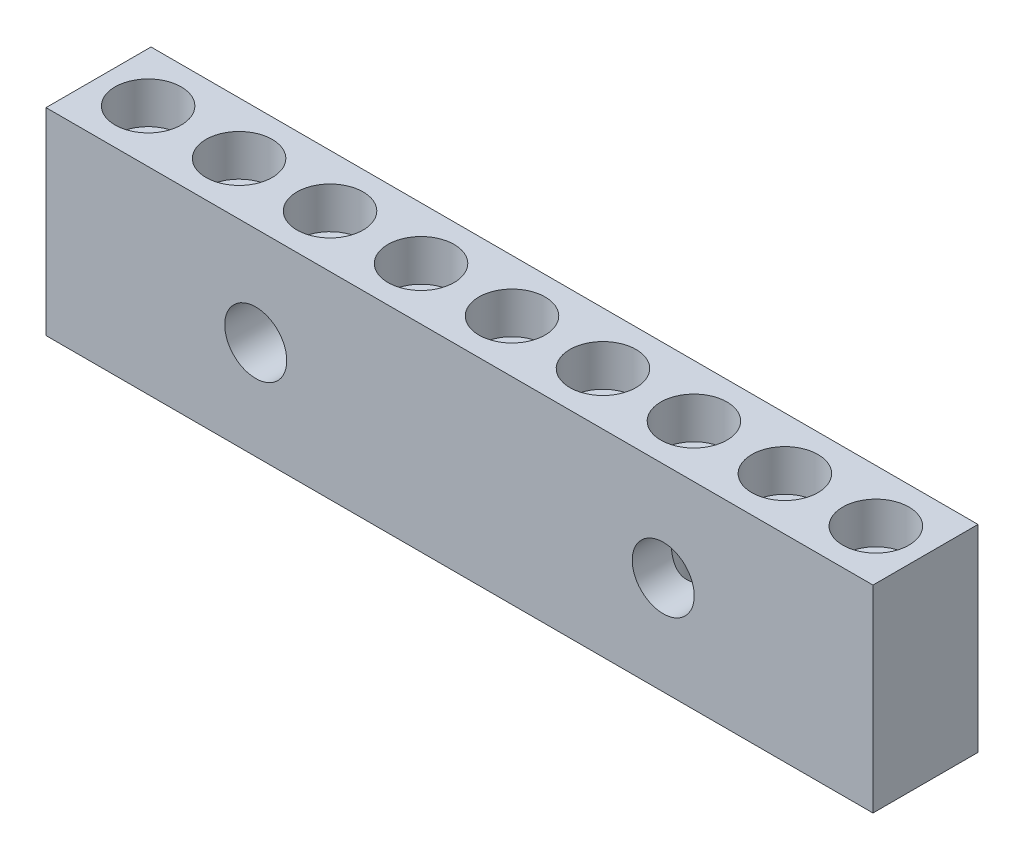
ISO-10303-21;
HEADER;
FILE_DESCRIPTION(('STEP AP214'),'2;1');
FILE_NAME('part.step','',(''),(''),'','','');
FILE_SCHEMA(('AUTOMOTIVE_DESIGN { 1 0 10303 214 1 1 1 1 }'));
ENDSEC;
DATA;
#1=APPLICATION_CONTEXT('core data for automotive mechanical design processes');
#2=APPLICATION_PROTOCOL_DEFINITION('international standard','automotive_design',2000,#1);
#3=PRODUCT_CONTEXT('',#1,'mechanical');
#4=PRODUCT('Part','Part','',(#3));
#5=PRODUCT_RELATED_PRODUCT_CATEGORY('part','',(#4));
#6=PRODUCT_DEFINITION_FORMATION('','',#4);
#7=PRODUCT_DEFINITION_CONTEXT('part definition',#1,'design');
#8=PRODUCT_DEFINITION('design','',#6,#7);
#9=PRODUCT_DEFINITION_SHAPE('','',#8);
#10=(LENGTH_UNIT() NAMED_UNIT(*) SI_UNIT(.MILLI.,.METRE.));
#11=(NAMED_UNIT(*) PLANE_ANGLE_UNIT() SI_UNIT($,.RADIAN.));
#12=(NAMED_UNIT(*) SI_UNIT($,.STERADIAN.) SOLID_ANGLE_UNIT());
#13=UNCERTAINTY_MEASURE_WITH_UNIT(LENGTH_MEASURE(1.E-05),#10,'distance_accuracy_value','');
#14=(GEOMETRIC_REPRESENTATION_CONTEXT(3) GLOBAL_UNCERTAINTY_ASSIGNED_CONTEXT((#13)) GLOBAL_UNIT_ASSIGNED_CONTEXT((#10,
#11,#12)) REPRESENTATION_CONTEXT('',''));
#15=CARTESIAN_POINT('',(0.,0.,0.));
#16=DIRECTION('',(0.,0.,1.));
#17=DIRECTION('',(1.,0.,0.));
#18=AXIS2_PLACEMENT_3D('',#15,#16,#17);
#19=CARTESIAN_POINT('',(-100.,-23.875,12.7));
#20=DIRECTION('',(1.,0.,0.));
#21=DIRECTION('',(0.,0.,-1.));
#22=AXIS2_PLACEMENT_3D('',#19,#20,#21);
#23=PLANE('',#22);
#24=DIRECTION('',(0.,-1.,0.));
#25=VECTOR('',#24,1.);
#26=CARTESIAN_POINT('',(-100.,-23.875,-12.7));
#27=LINE('',#26,#25);
#28=CARTESIAN_POINT('',(-100.,23.875,-12.7));
#29=VERTEX_POINT('',#28);
#30=CARTESIAN_POINT('',(-100.,-23.875,-12.7));
#31=VERTEX_POINT('',#30);
#32=EDGE_CURVE('E116',#29,#31,#27,.T.);
#33=ORIENTED_EDGE('',*,*,#32,.T.);
#34=DIRECTION('',(0.,0.,-1.));
#35=VECTOR('',#34,1.);
#36=CARTESIAN_POINT('',(-100.,-23.875,12.7));
#37=LINE('',#36,#35);
#38=CARTESIAN_POINT('',(-100.,-23.875,12.7));
#39=VERTEX_POINT('',#38);
#40=EDGE_CURVE('E11',#39,#31,#37,.T.);
#41=ORIENTED_EDGE('',*,*,#40,.F.);
#42=DIRECTION('',(0.,-1.,0.));
#43=VECTOR('',#42,1.);
#44=CARTESIAN_POINT('',(-100.,-23.875,12.7));
#45=LINE('',#44,#43);
#46=CARTESIAN_POINT('',(-100.,23.875,12.7));
#47=VERTEX_POINT('',#46);
#48=EDGE_CURVE('E97',#47,#39,#45,.T.);
#49=ORIENTED_EDGE('',*,*,#48,.F.);
#50=DIRECTION('',(0.,0.,-1.));
#51=VECTOR('',#50,1.);
#52=CARTESIAN_POINT('',(-100.,23.875,12.7));
#53=LINE('',#52,#51);
#54=EDGE_CURVE('E112',#47,#29,#53,.T.);
#55=ORIENTED_EDGE('',*,*,#54,.T.);
#56=EDGE_LOOP('',(#33,#41,#49,#55));
#57=FACE_BOUND('',#56,.T.);
#58=ADVANCED_FACE('F39',(#57),#23,.F.);
#59=CARTESIAN_POINT('',(100.,-23.875,12.7));
#60=DIRECTION('',(0.,1.,0.));
#61=DIRECTION('',(-1.,0.,0.));
#62=AXIS2_PLACEMENT_3D('',#59,#60,#61);
#63=PLANE('',#62);
#64=CARTESIAN_POINT('',(-66.,-23.875,0.));
#65=DIRECTION('',(0.,1.,0.));
#66=DIRECTION('',(-1.,0.,0.));
#67=AXIS2_PLACEMENT_3D('',#64,#65,#66);
#68=CIRCLE('',#67,4.00000000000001);
#69=CARTESIAN_POINT('',(-70.,-23.875,0.));
#70=VERTEX_POINT('',#69);
#71=EDGE_CURVE('E136',#70,#70,#68,.F.);
#72=ORIENTED_EDGE('',*,*,#71,.F.);
#73=EDGE_LOOP('',(#72));
#74=FACE_BOUND('',#73,.T.);
#75=CARTESIAN_POINT('',(-44.,-23.875,0.));
#76=DIRECTION('',(0.,1.,0.));
#77=DIRECTION('',(-1.,0.,0.));
#78=AXIS2_PLACEMENT_3D('',#75,#76,#77);
#79=CIRCLE('',#78,4.00000000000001);
#80=CARTESIAN_POINT('',(-48.,-23.875,0.));
#81=VERTEX_POINT('',#80);
#82=EDGE_CURVE('E527',#81,#81,#79,.F.);
#83=ORIENTED_EDGE('',*,*,#82,.F.);
#84=EDGE_LOOP('',(#83));
#85=FACE_BOUND('',#84,.T.);
#86=CARTESIAN_POINT('',(-22.,-23.875,0.));
#87=DIRECTION('',(0.,1.,0.));
#88=DIRECTION('',(-1.,0.,0.));
#89=AXIS2_PLACEMENT_3D('',#86,#87,#88);
#90=CIRCLE('',#89,4.00000000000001);
#91=CARTESIAN_POINT('',(-26.,-23.875,0.));
#92=VERTEX_POINT('',#91);
#93=EDGE_CURVE('E540',#92,#92,#90,.F.);
#94=ORIENTED_EDGE('',*,*,#93,.F.);
#95=EDGE_LOOP('',(#94));
#96=FACE_BOUND('',#95,.T.);
#97=CARTESIAN_POINT('',(0.,-23.875,0.));
#98=DIRECTION('',(0.,1.,0.));
#99=DIRECTION('',(-1.,0.,0.));
#100=AXIS2_PLACEMENT_3D('',#97,#98,#99);
#101=CIRCLE('',#100,4.00000000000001);
#102=CARTESIAN_POINT('',(-4.00000000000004,-23.875,0.));
#103=VERTEX_POINT('',#102);
#104=EDGE_CURVE('E546',#103,#103,#101,.F.);
#105=ORIENTED_EDGE('',*,*,#104,.F.);
#106=EDGE_LOOP('',(#105));
#107=FACE_BOUND('',#106,.T.);
#108=CARTESIAN_POINT('',(22.,-23.875,0.));
#109=DIRECTION('',(0.,1.,0.));
#110=DIRECTION('',(-1.,0.,0.));
#111=AXIS2_PLACEMENT_3D('',#108,#109,#110);
#112=CIRCLE('',#111,4.00000000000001);
#113=CARTESIAN_POINT('',(18.,-23.875,0.));
#114=VERTEX_POINT('',#113);
#115=EDGE_CURVE('E554',#114,#114,#112,.F.);
#116=ORIENTED_EDGE('',*,*,#115,.F.);
#117=EDGE_LOOP('',(#116));
#118=FACE_BOUND('',#117,.T.);
#119=CARTESIAN_POINT('',(44.,-23.875,0.));
#120=DIRECTION('',(0.,1.,0.));
#121=DIRECTION('',(-1.,0.,0.));
#122=AXIS2_PLACEMENT_3D('',#119,#120,#121);
#123=CIRCLE('',#122,4.00000000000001);
#124=CARTESIAN_POINT('',(40.,-23.875,0.));
#125=VERTEX_POINT('',#124);
#126=EDGE_CURVE('E562',#125,#125,#123,.F.);
#127=ORIENTED_EDGE('',*,*,#126,.F.);
#128=EDGE_LOOP('',(#127));
#129=FACE_BOUND('',#128,.T.);
#130=CARTESIAN_POINT('',(66.,-23.875,0.));
#131=DIRECTION('',(0.,1.,0.));
#132=DIRECTION('',(-1.,0.,0.));
#133=AXIS2_PLACEMENT_3D('',#130,#131,#132);
#134=CIRCLE('',#133,4.00000000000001);
#135=CARTESIAN_POINT('',(62.,-23.875,0.));
#136=VERTEX_POINT('',#135);
#137=EDGE_CURVE('E570',#136,#136,#134,.F.);
#138=ORIENTED_EDGE('',*,*,#137,.F.);
#139=EDGE_LOOP('',(#138));
#140=FACE_BOUND('',#139,.T.);
#141=CARTESIAN_POINT('',(88.,-23.875,0.));
#142=DIRECTION('',(0.,1.,0.));
#143=DIRECTION('',(-1.,0.,0.));
#144=AXIS2_PLACEMENT_3D('',#141,#142,#143);
#145=CIRCLE('',#144,4.00000000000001);
#146=CARTESIAN_POINT('',(83.9999999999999,-23.875,0.));
#147=VERTEX_POINT('',#146);
#148=EDGE_CURVE('E578',#147,#147,#145,.F.);
#149=ORIENTED_EDGE('',*,*,#148,.F.);
#150=EDGE_LOOP('',(#149));
#151=FACE_BOUND('',#150,.T.);
#152=CARTESIAN_POINT('',(-88.,-23.875,0.));
#153=DIRECTION('',(0.,1.,0.));
#154=DIRECTION('',(-1.,0.,0.));
#155=AXIS2_PLACEMENT_3D('',#152,#153,#154);
#156=CIRCLE('',#155,4.00000000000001);
#157=CARTESIAN_POINT('',(-92.,-23.875,0.));
#158=VERTEX_POINT('',#157);
#159=EDGE_CURVE('E656',#158,#158,#156,.F.);
#160=ORIENTED_EDGE('',*,*,#159,.F.);
#161=EDGE_LOOP('',(#160));
#162=FACE_BOUND('',#161,.T.);
#163=DIRECTION('',(1.,0.,0.));
#164=VECTOR('',#163,1.);
#165=CARTESIAN_POINT('',(100.,-23.875,-12.7));
#166=LINE('',#165,#164);
#167=CARTESIAN_POINT('',(100.,-23.875,-12.7));
#168=VERTEX_POINT('',#167);
#169=EDGE_CURVE('E102',#31,#168,#166,.T.);
#170=ORIENTED_EDGE('',*,*,#169,.T.);
#171=DIRECTION('',(0.,0.,-1.));
#172=VECTOR('',#171,1.);
#173=CARTESIAN_POINT('',(100.,-23.875,12.7));
#174=LINE('',#173,#172);
#175=CARTESIAN_POINT('',(100.,-23.875,12.7));
#176=VERTEX_POINT('',#175);
#177=EDGE_CURVE('E53',#176,#168,#174,.T.);
#178=ORIENTED_EDGE('',*,*,#177,.F.);
#179=DIRECTION('',(1.,0.,0.));
#180=VECTOR('',#179,1.);
#181=CARTESIAN_POINT('',(100.,-23.875,12.7));
#182=LINE('',#181,#180);
#183=EDGE_CURVE('E92',#39,#176,#182,.T.);
#184=ORIENTED_EDGE('',*,*,#183,.F.);
#185=ORIENTED_EDGE('',*,*,#40,.T.);
#186=EDGE_LOOP('',(#170,#178,#184,#185));
#187=FACE_BOUND('',#186,.T.);
#188=ADVANCED_FACE('F101',(#74,#85,#96,#107,#118,#129,#140,#151,#162,#187),#63,.F.);
#189=CARTESIAN_POINT('',(100.,-23.875,12.7));
#190=DIRECTION('',(-1.,0.,0.));
#191=DIRECTION('',(0.,0.,1.));
#192=AXIS2_PLACEMENT_3D('',#189,#190,#191);
#193=PLANE('',#192);
#194=DIRECTION('',(0.,1.,0.));
#195=VECTOR('',#194,1.);
#196=CARTESIAN_POINT('',(100.,-23.875,-12.7));
#197=LINE('',#196,#195);
#198=CARTESIAN_POINT('',(100.,23.875,-12.7));
#199=VERTEX_POINT('',#198);
#200=EDGE_CURVE('E79',#168,#199,#197,.T.);
#201=ORIENTED_EDGE('',*,*,#200,.T.);
#202=DIRECTION('',(0.,0.,-1.));
#203=VECTOR('',#202,1.);
#204=CARTESIAN_POINT('',(100.,23.875,12.7));
#205=LINE('',#204,#203);
#206=CARTESIAN_POINT('',(100.,23.875,12.7));
#207=VERTEX_POINT('',#206);
#208=EDGE_CURVE('E104',#207,#199,#205,.T.);
#209=ORIENTED_EDGE('',*,*,#208,.F.);
#210=DIRECTION('',(0.,1.,0.));
#211=VECTOR('',#210,1.);
#212=CARTESIAN_POINT('',(100.,-23.875,12.7));
#213=LINE('',#212,#211);
#214=EDGE_CURVE('E95',#176,#207,#213,.T.);
#215=ORIENTED_EDGE('',*,*,#214,.F.);
#216=ORIENTED_EDGE('',*,*,#177,.T.);
#217=EDGE_LOOP('',(#201,#209,#215,#216));
#218=FACE_BOUND('',#217,.T.);
#219=ADVANCED_FACE('F106',(#218),#193,.F.);
#220=CARTESIAN_POINT('',(100.,23.875,12.7));
#221=DIRECTION('',(0.,-1.,0.));
#222=DIRECTION('',(1.,0.,0.));
#223=AXIS2_PLACEMENT_3D('',#220,#221,#222);
#224=PLANE('',#223);
#225=CARTESIAN_POINT('',(-66.,23.875,0.));
#226=DIRECTION('',(0.,1.,0.));
#227=DIRECTION('',(-1.,0.,0.));
#228=AXIS2_PLACEMENT_3D('',#225,#226,#227);
#229=CIRCLE('',#228,8.);
#230=CARTESIAN_POINT('',(-74.,23.875,0.));
#231=VERTEX_POINT('',#230);
#232=EDGE_CURVE('E594',#231,#231,#229,.T.);
#233=ORIENTED_EDGE('',*,*,#232,.F.);
#234=EDGE_LOOP('',(#233));
#235=FACE_BOUND('',#234,.T.);
#236=CARTESIAN_POINT('',(-44.,23.875,0.));
#237=DIRECTION('',(0.,1.,0.));
#238=DIRECTION('',(-1.,0.,0.));
#239=AXIS2_PLACEMENT_3D('',#236,#237,#238);
#240=CIRCLE('',#239,8.);
#241=CARTESIAN_POINT('',(-52.,23.875,0.));
#242=VERTEX_POINT('',#241);
#243=EDGE_CURVE('E602',#242,#242,#240,.T.);
#244=ORIENTED_EDGE('',*,*,#243,.F.);
#245=EDGE_LOOP('',(#244));
#246=FACE_BOUND('',#245,.T.);
#247=CARTESIAN_POINT('',(-22.,23.875,0.));
#248=DIRECTION('',(0.,1.,0.));
#249=DIRECTION('',(-1.,0.,0.));
#250=AXIS2_PLACEMENT_3D('',#247,#248,#249);
#251=CIRCLE('',#250,8.);
#252=CARTESIAN_POINT('',(-30.,23.875,0.));
#253=VERTEX_POINT('',#252);
#254=EDGE_CURVE('E609',#253,#253,#251,.T.);
#255=ORIENTED_EDGE('',*,*,#254,.F.);
#256=EDGE_LOOP('',(#255));
#257=FACE_BOUND('',#256,.T.);
#258=CARTESIAN_POINT('',(0.,23.875,0.));
#259=DIRECTION('',(0.,1.,0.));
#260=DIRECTION('',(-1.,0.,0.));
#261=AXIS2_PLACEMENT_3D('',#258,#259,#260);
#262=CIRCLE('',#261,8.);
#263=CARTESIAN_POINT('',(-8.00000000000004,23.875,0.));
#264=VERTEX_POINT('',#263);
#265=EDGE_CURVE('E617',#264,#264,#262,.T.);
#266=ORIENTED_EDGE('',*,*,#265,.F.);
#267=EDGE_LOOP('',(#266));
#268=FACE_BOUND('',#267,.T.);
#269=CARTESIAN_POINT('',(22.,23.875,0.));
#270=DIRECTION('',(0.,1.,0.));
#271=DIRECTION('',(-1.,0.,0.));
#272=AXIS2_PLACEMENT_3D('',#269,#270,#271);
#273=CIRCLE('',#272,8.);
#274=CARTESIAN_POINT('',(14.,23.875,0.));
#275=VERTEX_POINT('',#274);
#276=EDGE_CURVE('E625',#275,#275,#273,.T.);
#277=ORIENTED_EDGE('',*,*,#276,.F.);
#278=EDGE_LOOP('',(#277));
#279=FACE_BOUND('',#278,.T.);
#280=CARTESIAN_POINT('',(44.,23.875,0.));
#281=DIRECTION('',(0.,1.,0.));
#282=DIRECTION('',(-1.,0.,0.));
#283=AXIS2_PLACEMENT_3D('',#280,#281,#282);
#284=CIRCLE('',#283,8.);
#285=CARTESIAN_POINT('',(36.,23.875,0.));
#286=VERTEX_POINT('',#285);
#287=EDGE_CURVE('E633',#286,#286,#284,.T.);
#288=ORIENTED_EDGE('',*,*,#287,.F.);
#289=EDGE_LOOP('',(#288));
#290=FACE_BOUND('',#289,.T.);
#291=CARTESIAN_POINT('',(66.,23.875,0.));
#292=DIRECTION('',(0.,1.,0.));
#293=DIRECTION('',(-1.,0.,0.));
#294=AXIS2_PLACEMENT_3D('',#291,#292,#293);
#295=CIRCLE('',#294,8.);
#296=CARTESIAN_POINT('',(58.,23.875,0.));
#297=VERTEX_POINT('',#296);
#298=EDGE_CURVE('E641',#297,#297,#295,.T.);
#299=ORIENTED_EDGE('',*,*,#298,.F.);
#300=EDGE_LOOP('',(#299));
#301=FACE_BOUND('',#300,.T.);
#302=CARTESIAN_POINT('',(88.,23.875,0.));
#303=DIRECTION('',(0.,1.,0.));
#304=DIRECTION('',(-1.,0.,0.));
#305=AXIS2_PLACEMENT_3D('',#302,#303,#304);
#306=CIRCLE('',#305,8.);
#307=CARTESIAN_POINT('',(80.,23.875,0.));
#308=VERTEX_POINT('',#307);
#309=EDGE_CURVE('E649',#308,#308,#306,.T.);
#310=ORIENTED_EDGE('',*,*,#309,.F.);
#311=EDGE_LOOP('',(#310));
#312=FACE_BOUND('',#311,.T.);
#313=CARTESIAN_POINT('',(-88.,23.875,0.));
#314=DIRECTION('',(0.,1.,0.));
#315=DIRECTION('',(-1.,0.,0.));
#316=AXIS2_PLACEMENT_3D('',#313,#314,#315);
#317=CIRCLE('',#316,8.);
#318=CARTESIAN_POINT('',(-96.,23.875,0.));
#319=VERTEX_POINT('',#318);
#320=EDGE_CURVE('E660',#319,#319,#317,.T.);
#321=ORIENTED_EDGE('',*,*,#320,.F.);
#322=EDGE_LOOP('',(#321));
#323=FACE_BOUND('',#322,.T.);
#324=DIRECTION('',(-1.,0.,0.));
#325=VECTOR('',#324,1.);
#326=CARTESIAN_POINT('',(100.,23.875,-12.7));
#327=LINE('',#326,#325);
#328=EDGE_CURVE('E85',#199,#29,#327,.T.);
#329=ORIENTED_EDGE('',*,*,#328,.T.);
#330=ORIENTED_EDGE('',*,*,#54,.F.);
#331=DIRECTION('',(-1.,0.,0.));
#332=VECTOR('',#331,1.);
#333=CARTESIAN_POINT('',(100.,23.875,12.7));
#334=LINE('',#333,#332);
#335=EDGE_CURVE('E62',#207,#47,#334,.T.);
#336=ORIENTED_EDGE('',*,*,#335,.F.);
#337=ORIENTED_EDGE('',*,*,#208,.T.);
#338=EDGE_LOOP('',(#329,#330,#336,#337));
#339=FACE_BOUND('',#338,.T.);
#340=ADVANCED_FACE('F269',(#235,#246,#257,#268,#279,#290,#301,#312,#323,#339),#224,.F.);
#341=CARTESIAN_POINT('',(0.,0.,12.7));
#342=DIRECTION('',(0.,0.,1.));
#343=DIRECTION('',(1.,0.,0.));
#344=AXIS2_PLACEMENT_3D('',#341,#342,#343);
#345=PLANE('',#344);
#346=CARTESIAN_POINT('',(-49.275,-0.00500000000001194,12.7));
#347=DIRECTION('',(0.,0.,1.));
#348=DIRECTION('',(1.,0.,0.));
#349=AXIS2_PLACEMENT_3D('',#346,#347,#348);
#350=CIRCLE('',#349,7.5);
#351=CARTESIAN_POINT('',(-41.775,-0.00500000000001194,12.7));
#352=VERTEX_POINT('',#351);
#353=EDGE_CURVE('E668',#352,#352,#350,.T.);
#354=ORIENTED_EDGE('',*,*,#353,.F.);
#355=EDGE_LOOP('',(#354));
#356=FACE_BOUND('',#355,.T.);
#357=CARTESIAN_POINT('',(49.275,-0.00500000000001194,12.7));
#358=DIRECTION('',(0.,0.,1.));
#359=DIRECTION('',(1.,0.,0.));
#360=AXIS2_PLACEMENT_3D('',#357,#358,#359);
#361=CIRCLE('',#360,7.50000000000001);
#362=CARTESIAN_POINT('',(56.775,-0.00500000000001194,12.7));
#363=VERTEX_POINT('',#362);
#364=EDGE_CURVE('E664',#363,#363,#361,.T.);
#365=ORIENTED_EDGE('',*,*,#364,.F.);
#366=EDGE_LOOP('',(#365));
#367=FACE_BOUND('',#366,.T.);
#368=ORIENTED_EDGE('',*,*,#48,.T.);
#369=ORIENTED_EDGE('',*,*,#183,.T.);
#370=ORIENTED_EDGE('',*,*,#214,.T.);
#371=ORIENTED_EDGE('',*,*,#335,.T.);
#372=EDGE_LOOP('',(#368,#369,#370,#371));
#373=FACE_BOUND('',#372,.T.);
#374=ADVANCED_FACE('F93',(#356,#367,#373),#345,.T.);
#375=CARTESIAN_POINT('',(0.,0.,-12.7));
#376=DIRECTION('',(0.,0.,1.));
#377=DIRECTION('',(1.,0.,0.));
#378=AXIS2_PLACEMENT_3D('',#375,#376,#377);
#379=PLANE('',#378);
#380=CARTESIAN_POINT('',(-49.275,-0.00500000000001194,-12.7));
#381=DIRECTION('',(0.,0.,1.));
#382=DIRECTION('',(1.,0.,0.));
#383=AXIS2_PLACEMENT_3D('',#380,#381,#382);
#384=CIRCLE('',#383,7.5);
#385=CARTESIAN_POINT('',(-41.775,-0.00500000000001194,-12.7));
#386=VERTEX_POINT('',#385);
#387=EDGE_CURVE('E120',#386,#386,#384,.F.);
#388=ORIENTED_EDGE('',*,*,#387,.F.);
#389=EDGE_LOOP('',(#388));
#390=FACE_BOUND('',#389,.T.);
#391=CARTESIAN_POINT('',(49.275,-0.00500000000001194,-12.7));
#392=DIRECTION('',(0.,0.,1.));
#393=DIRECTION('',(1.,0.,0.));
#394=AXIS2_PLACEMENT_3D('',#391,#392,#393);
#395=CIRCLE('',#394,7.50000000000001);
#396=CARTESIAN_POINT('',(56.775,-0.00500000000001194,-12.7));
#397=VERTEX_POINT('',#396);
#398=EDGE_CURVE('E671',#397,#397,#395,.F.);
#399=ORIENTED_EDGE('',*,*,#398,.F.);
#400=EDGE_LOOP('',(#399));
#401=FACE_BOUND('',#400,.T.);
#402=ORIENTED_EDGE('',*,*,#32,.F.);
#403=ORIENTED_EDGE('',*,*,#328,.F.);
#404=ORIENTED_EDGE('',*,*,#200,.F.);
#405=ORIENTED_EDGE('',*,*,#169,.F.);
#406=EDGE_LOOP('',(#402,#403,#404,#405));
#407=FACE_BOUND('',#406,.T.);
#408=ADVANCED_FACE('F260',(#390,#401,#407),#379,.F.);
#409=CARTESIAN_POINT('',(49.275,-0.00500000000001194,-33.9132034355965));
#410=DIRECTION('',(0.,0.,1.));
#411=DIRECTION('',(1.,0.,0.));
#412=AXIS2_PLACEMENT_3D('',#409,#410,#411);
#413=CYLINDRICAL_SURFACE('',#412,7.50000000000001);
#414=CARTESIAN_POINT('',(41.7749999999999,-0.00500000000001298,-3.3240600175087));
#415=CARTESIAN_POINT('',(41.7750011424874,-0.174158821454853,-3.3240634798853));
#416=CARTESIAN_POINT('',(41.7807314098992,-0.343360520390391,-3.32791870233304));
#417=CARTESIAN_POINT('',(41.8035858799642,-0.680710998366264,-3.34304421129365));
#418=CARTESIAN_POINT('',(41.8207159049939,-0.848859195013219,-3.35431828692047));
#419=CARTESIAN_POINT('',(41.8662287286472,-1.18341310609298,-3.38345236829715));
#420=CARTESIAN_POINT('',(41.8946350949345,-1.3498144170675,-3.40132616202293));
#421=CARTESIAN_POINT('',(41.9624259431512,-1.67971281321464,-3.44236120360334));
#422=CARTESIAN_POINT('',(42.0018149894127,-1.8432086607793,-3.46552464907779));
#423=CARTESIAN_POINT('',(42.1441148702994,-2.35746983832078,-3.54517179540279));
#424=CARTESIAN_POINT('',(42.2671788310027,-2.70184997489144,-3.60875160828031));
#425=CARTESIAN_POINT('',(42.4879939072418,-3.20185102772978,-3.70408442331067));
#426=CARTESIAN_POINT('',(42.5676739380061,-3.3658177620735,-3.73586837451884));
#427=CARTESIAN_POINT('',(42.7389887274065,-3.68790399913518,-3.79712133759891));
#428=CARTESIAN_POINT('',(42.8306225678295,-3.84602394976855,-3.82659052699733));
#429=CARTESIAN_POINT('',(43.0149567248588,-4.13881710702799,-3.87786229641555));
#430=CARTESIAN_POINT('',(43.1064504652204,-4.27416653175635,-3.9001505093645));
#431=CARTESIAN_POINT('',(43.2984715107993,-4.53907604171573,-3.93921975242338));
#432=CARTESIAN_POINT('',(43.3989948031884,-4.66863866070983,-3.95600321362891));
#433=CARTESIAN_POINT('',(43.6086052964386,-4.92118412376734,-3.98220454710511));
#434=CARTESIAN_POINT('',(43.7176817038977,-5.04417494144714,-3.99163154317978));
#435=CARTESIAN_POINT('',(43.9438879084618,-5.28290234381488,-4.00120680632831));
#436=CARTESIAN_POINT('',(44.0610151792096,-5.39864118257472,-4.00135797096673));
#437=CARTESIAN_POINT('',(44.2726164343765,-5.59441155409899,-3.9917374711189));
#438=CARTESIAN_POINT('',(44.3655648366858,-5.67621682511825,-3.98440054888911));
#439=CARTESIAN_POINT('',(44.5548801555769,-5.83472532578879,-3.96247185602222));
#440=CARTESIAN_POINT('',(44.6512461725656,-5.91142988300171,-3.94788198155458));
#441=CARTESIAN_POINT('',(44.8466114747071,-6.05928576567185,-3.91064348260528));
#442=CARTESIAN_POINT('',(44.9456098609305,-6.13043895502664,-3.88799757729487));
#443=CARTESIAN_POINT('',(45.1453057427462,-6.26680816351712,-3.83392394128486));
#444=CARTESIAN_POINT('',(45.2460032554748,-6.33202412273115,-3.80249612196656));
#445=CARTESIAN_POINT('',(45.4487978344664,-6.45670238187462,-3.72997013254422));
#446=CARTESIAN_POINT('',(45.5508995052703,-6.51611071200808,-3.68879156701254));
#447=CARTESIAN_POINT('',(45.7542822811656,-6.62829483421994,-3.59652059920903));
#448=CARTESIAN_POINT('',(45.8555633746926,-6.68107053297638,-3.54542805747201));
#449=CARTESIAN_POINT('',(46.0557758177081,-6.77988417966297,-3.43321262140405));
#450=CARTESIAN_POINT('',(46.154708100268,-6.82592484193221,-3.37209378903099));
#451=CARTESIAN_POINT('',(46.3487306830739,-6.9113872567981,-3.23994365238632));
#452=CARTESIAN_POINT('',(46.4438214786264,-6.95080986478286,-3.16891363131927));
#453=CARTESIAN_POINT('',(46.6164597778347,-7.01852957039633,-3.02735950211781));
#454=CARTESIAN_POINT('',(46.6946655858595,-7.0476083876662,-2.95800756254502));
#455=CARTESIAN_POINT('',(46.8461952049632,-7.10129271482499,-2.8125090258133));
#456=CARTESIAN_POINT('',(46.9195173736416,-7.12589672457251,-2.7363601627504));
#457=CARTESIAN_POINT('',(47.0603987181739,-7.17096202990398,-2.57782872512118));
#458=CARTESIAN_POINT('',(47.1279602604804,-7.19142503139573,-2.4954487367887));
#459=CARTESIAN_POINT('',(47.2566653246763,-7.2286289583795,-2.324982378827));
#460=CARTESIAN_POINT('',(47.3178064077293,-7.24536847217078,-2.23689386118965));
#461=CARTESIAN_POINT('',(47.4314031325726,-7.27511030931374,-2.05824060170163));
#462=CARTESIAN_POINT('',(47.4840555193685,-7.28820494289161,-1.96781636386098));
#463=CARTESIAN_POINT('',(47.5822472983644,-7.31164954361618,-1.78283218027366));
#464=CARTESIAN_POINT('',(47.6277841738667,-7.32199854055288,-1.68827078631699));
#465=CARTESIAN_POINT('',(47.7530802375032,-7.34946416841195,-1.39940405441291));
#466=CARTESIAN_POINT('',(47.8216331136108,-7.36302596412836,-1.199746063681));
#467=CARTESIAN_POINT('',(47.9281471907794,-7.38328206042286,-0.785437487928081));
#468=CARTESIAN_POINT('',(47.9650722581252,-7.38974558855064,-0.570512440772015));
#469=CARTESIAN_POINT('',(48.0035466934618,-7.39646745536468,-0.137380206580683));
#470=CARTESIAN_POINT('',(48.0050909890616,-7.39672490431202,0.080827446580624));
#471=CARTESIAN_POINT('',(47.9724404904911,-7.39104238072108,0.518343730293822));
#472=CARTESIAN_POINT('',(47.9376169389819,-7.38499338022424,0.737604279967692));
#473=CARTESIAN_POINT('',(47.8323417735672,-7.36513451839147,1.16705884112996));
#474=CARTESIAN_POINT('',(47.761888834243,-7.3513243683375,1.37725251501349));
#475=CARTESIAN_POINT('',(47.5880582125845,-7.31335616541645,1.78158893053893));
#476=CARTESIAN_POINT('',(47.4848120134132,-7.28923930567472,1.97579193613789));
#477=CARTESIAN_POINT('',(47.2491786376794,-7.22724451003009,2.34316279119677));
#478=CARTESIAN_POINT('',(47.1168009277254,-7.18937104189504,2.51633744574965));
#479=CARTESIAN_POINT('',(46.8324466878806,-7.09764189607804,2.83216580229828));
#480=CARTESIAN_POINT('',(46.6811002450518,-7.04424832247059,2.97552081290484));
#481=CARTESIAN_POINT('',(46.3629352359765,-6.91868523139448,3.23396435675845));
#482=CARTESIAN_POINT('',(46.1961208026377,-6.8465207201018,3.34906041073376));
#483=CARTESIAN_POINT('',(45.8581937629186,-6.6840594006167,3.54750019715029));
#484=CARTESIAN_POINT('',(45.6872394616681,-6.59416479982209,3.63144669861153));
#485=CARTESIAN_POINT('',(45.3448261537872,-6.39584531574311,3.77169980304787));
#486=CARTESIAN_POINT('',(45.1733670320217,-6.28741582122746,3.82799951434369));
#487=CARTESIAN_POINT('',(44.8241975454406,-6.04557282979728,3.91860518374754));
#488=CARTESIAN_POINT('',(44.6468705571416,-5.91095259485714,3.95112827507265));
#489=CARTESIAN_POINT('',(44.3033942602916,-5.62489160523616,3.99223353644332));
#490=CARTESIAN_POINT('',(44.1372522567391,-5.47344002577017,4.00080020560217));
#491=CARTESIAN_POINT('',(43.8527793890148,-5.18969331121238,3.99926275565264));
#492=CARTESIAN_POINT('',(43.7317306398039,-5.06004541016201,3.99269868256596));
#493=CARTESIAN_POINT('',(43.4994372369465,-4.79292362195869,3.97027169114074));
#494=CARTESIAN_POINT('',(43.3881973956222,-4.65544594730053,3.95440423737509));
#495=CARTESIAN_POINT('',(43.1759058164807,-4.37332771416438,3.91567838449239));
#496=CARTESIAN_POINT('',(43.0748768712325,-4.22867216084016,3.89280478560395));
#497=CARTESIAN_POINT('',(42.8836280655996,-3.93327558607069,3.84232920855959));
#498=CARTESIAN_POINT('',(42.7934070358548,-3.78253522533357,3.8147277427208));
#499=CARTESIAN_POINT('',(42.5337227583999,-3.31198494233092,3.72615102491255));
#500=CARTESIAN_POINT('',(42.3820289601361,-2.98286263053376,3.66090104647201));
#501=CARTESIAN_POINT('',(42.1911122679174,-2.47507603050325,3.56832152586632));
#502=CARTESIAN_POINT('',(42.1335801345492,-2.30347589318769,3.53834618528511));
#503=CARTESIAN_POINT('',(42.0309422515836,-1.95599864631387,3.482274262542));
#504=CARTESIAN_POINT('',(41.9858305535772,-1.78012362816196,3.45617582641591));
#505=CARTESIAN_POINT('',(41.9088888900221,-1.42718109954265,3.41016757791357));
#506=CARTESIAN_POINT('',(41.8768901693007,-1.25016060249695,3.39018003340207));
#507=CARTESIAN_POINT('',(41.8256500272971,-0.893600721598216,3.35754841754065));
#508=CARTESIAN_POINT('',(41.8064077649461,-0.714061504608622,3.3449038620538));
#509=CARTESIAN_POINT('',(41.7809441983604,-0.353843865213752,3.32806678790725));
#510=CARTESIAN_POINT('',(41.7747094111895,-0.173166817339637,3.32386551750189));
#511=CARTESIAN_POINT('',(41.7753114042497,0.188156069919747,3.32426845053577));
#512=CARTESIAN_POINT('',(41.7821482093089,0.368801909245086,3.32887267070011));
#513=CARTESIAN_POINT('',(41.8087640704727,0.728309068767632,3.34645095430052));
#514=CARTESIAN_POINT('',(41.8285143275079,0.90717346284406,3.35940639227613));
#515=CARTESIAN_POINT('',(41.880675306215,1.2623557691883,3.39255231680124));
#516=CARTESIAN_POINT('',(41.9130867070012,1.43867354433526,3.41274319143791));
#517=CARTESIAN_POINT('',(41.9903193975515,1.78819028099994,3.45878636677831));
#518=CARTESIAN_POINT('',(42.0351664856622,1.96138195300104,3.4846504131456));
#519=CARTESIAN_POINT('',(42.1369112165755,2.30358593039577,3.54009234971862));
#520=CARTESIAN_POINT('',(42.1938107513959,2.47259757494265,3.56967082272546));
#521=CARTESIAN_POINT('',(42.3246987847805,2.81999609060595,3.63305494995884));
#522=CARTESIAN_POINT('',(42.3997255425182,2.99796704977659,3.66700654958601));
#523=CARTESIAN_POINT('',(42.5633059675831,3.34768297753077,3.73413001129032));
#524=CARTESIAN_POINT('',(42.6518615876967,3.51942704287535,3.76730176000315));
#525=CARTESIAN_POINT('',(42.937304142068,4.02396230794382,3.86145387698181));
#526=CARTESIAN_POINT('',(43.1542714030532,4.34686587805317,3.9172421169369));
#527=CARTESIAN_POINT('',(43.5738721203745,4.8764740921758,3.98128217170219));
#528=CARTESIAN_POINT('',(43.7649475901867,5.09122980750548,3.99823468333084));
#529=CARTESIAN_POINT('',(44.0690597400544,5.39581665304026,4.00068690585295));
#530=CARTESIAN_POINT('',(44.1733140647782,5.49439500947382,3.99767910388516));
#531=CARTESIAN_POINT('',(44.3869598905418,5.68512569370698,3.98267759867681));
#532=CARTESIAN_POINT('',(44.4963503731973,5.77727928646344,3.97068566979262));
#533=CARTESIAN_POINT('',(44.6985459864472,5.93802352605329,3.93960251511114));
#534=CARTESIAN_POINT('',(44.7906648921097,6.00781466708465,3.92224020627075));
#535=CARTESIAN_POINT('',(44.976881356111,6.14230482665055,3.88005306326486));
#536=CARTESIAN_POINT('',(45.070978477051,6.20700495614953,3.85522986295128));
#537=CARTESIAN_POINT('',(45.2602576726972,6.33097977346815,3.79756949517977));
#538=CARTESIAN_POINT('',(45.3554394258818,6.39025602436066,3.76473464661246));
#539=CARTESIAN_POINT('',(45.5458879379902,6.50314689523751,3.69061910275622));
#540=CARTESIAN_POINT('',(45.6411546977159,6.55676146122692,3.64933832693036));
#541=CARTESIAN_POINT('',(45.8311758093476,6.65846424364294,3.55780543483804));
#542=CARTESIAN_POINT('',(45.9259239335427,6.70651841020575,3.50750240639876));
#543=CARTESIAN_POINT('',(46.1130965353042,6.79670272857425,3.39802535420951));
#544=CARTESIAN_POINT('',(46.205520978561,6.83883279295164,3.33885119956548));
#545=CARTESIAN_POINT('',(46.3867713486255,6.917274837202,3.21178626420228));
#546=CARTESIAN_POINT('',(46.4755974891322,6.95358716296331,3.14389600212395));
#547=CARTESIAN_POINT('',(46.6484260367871,7.02064607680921,2.99974973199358));
#548=CARTESIAN_POINT('',(46.732428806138,7.05139308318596,2.92349435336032));
#549=CARTESIAN_POINT('',(46.8865921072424,7.10495838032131,2.77095257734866));
#550=CARTESIAN_POINT('',(46.9573043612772,7.12825692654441,2.69539023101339));
#551=CARTESIAN_POINT('',(47.0931560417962,7.17097587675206,2.53833969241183));
#552=CARTESIAN_POINT('',(47.1582935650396,7.19039495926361,2.45684949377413));
#553=CARTESIAN_POINT('',(47.2822885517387,7.22571625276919,2.28855902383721));
#554=CARTESIAN_POINT('',(47.3411484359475,7.24161982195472,2.20176081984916));
#555=CARTESIAN_POINT('',(47.4520838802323,7.27031863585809,2.02340127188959));
#556=CARTESIAN_POINT('',(47.5041568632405,7.2831127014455,1.93183813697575));
#557=CARTESIAN_POINT('',(47.6011079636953,7.3059899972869,1.74446595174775));
#558=CARTESIAN_POINT('',(47.6459747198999,7.31606896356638,1.64865049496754));
#559=CARTESIAN_POINT('',(47.7280505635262,7.33384865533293,1.45356663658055));
#560=CARTESIAN_POINT('',(47.7652568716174,7.34154851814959,1.3542969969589));
#561=CARTESIAN_POINT('',(47.8648798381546,7.361562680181,1.05239063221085));
#562=CARTESIAN_POINT('',(47.9153898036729,7.37081112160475,0.845483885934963));
#563=CARTESIAN_POINT('',(47.9839614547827,7.38313365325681,0.419543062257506));
#564=CARTESIAN_POINT('',(48.0009636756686,7.38600649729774,0.200331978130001));
#565=CARTESIAN_POINT('',(47.9994527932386,7.38573117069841,-0.128175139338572));
#566=CARTESIAN_POINT('',(47.9944359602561,7.38487345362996,-0.237689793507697));
#567=CARTESIAN_POINT('',(47.9754403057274,7.3815591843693,-0.45590397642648));
#568=CARTESIAN_POINT('',(47.9614645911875,7.3791031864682,-0.564603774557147));
#569=CARTESIAN_POINT('',(47.9244424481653,7.37242141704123,-0.781676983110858));
#570=CARTESIAN_POINT('',(47.9012933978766,7.36817558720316,-0.89003221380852));
#571=CARTESIAN_POINT('',(47.8461289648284,7.35768402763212,-1.10432150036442));
#572=CARTESIAN_POINT('',(47.8141169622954,7.35143906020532,-1.21025646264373));
#573=CARTESIAN_POINT('',(47.7414744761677,7.33663963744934,-1.41900921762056));
#574=CARTESIAN_POINT('',(47.7008407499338,7.32808431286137,-1.52182582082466));
#575=CARTESIAN_POINT('',(47.6113344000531,7.30829715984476,-1.72349305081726));
#576=CARTESIAN_POINT('',(47.5624651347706,7.29706642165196,-1.82234527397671));
#577=CARTESIAN_POINT('',(47.4574514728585,7.27163419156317,-2.01442055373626));
#578=CARTESIAN_POINT('',(47.4013840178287,7.25746326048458,-2.10768970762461));
#579=CARTESIAN_POINT('',(47.2821688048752,7.22565877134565,-2.28891371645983));
#580=CARTESIAN_POINT('',(47.219023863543,7.20802658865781,-2.37687066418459));
#581=CARTESIAN_POINT('',(47.0862963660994,7.16886653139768,-2.54684102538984));
#582=CARTESIAN_POINT('',(47.0167147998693,7.14733925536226,-2.62885534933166));
#583=CARTESIAN_POINT('',(46.8718683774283,7.09998143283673,-2.78636285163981));
#584=CARTESIAN_POINT('',(46.7966037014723,7.07415102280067,-2.86185623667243));
#585=CARTESIAN_POINT('',(46.6437208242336,7.01872894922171,-3.00354061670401));
#586=CARTESIAN_POINT('',(46.5662528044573,6.9892824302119,-3.06995059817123));
#587=CARTESIAN_POINT('',(46.4076365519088,6.92576658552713,-3.19586336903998));
#588=CARTESIAN_POINT('',(46.3264870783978,6.89169569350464,-3.25536380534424));
#589=CARTESIAN_POINT('',(46.1614933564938,6.81879696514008,-3.36717585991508));
#590=CARTESIAN_POINT('',(46.0776505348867,6.77997161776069,-3.41949120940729));
#591=CARTESIAN_POINT('',(45.908133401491,6.69746948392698,-3.51690024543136));
#592=CARTESIAN_POINT('',(45.8224584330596,6.65379093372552,-3.56199129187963));
#593=CARTESIAN_POINT('',(45.650588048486,6.56181790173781,-3.64480746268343));
#594=CARTESIAN_POINT('',(45.5643963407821,6.51354362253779,-3.68256279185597));
#595=CARTESIAN_POINT('',(45.3919594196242,6.41231998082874,-3.75114157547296));
#596=CARTESIAN_POINT('',(45.3057141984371,6.35936879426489,-3.78196230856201));
#597=CARTESIAN_POINT('',(45.1339763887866,6.24898613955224,-3.83695558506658));
#598=CARTESIAN_POINT('',(45.0484838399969,6.19155443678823,-3.86112778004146));
#599=CARTESIAN_POINT('',(44.8789254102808,6.0724395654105,-3.90321981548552));
#600=CARTESIAN_POINT('',(44.794859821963,6.01075553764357,-3.92113838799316));
#601=CARTESIAN_POINT('',(44.5971267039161,5.85915874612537,-3.95689453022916));
#602=CARTESIAN_POINT('',(44.4843650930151,5.76743471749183,-3.97210765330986));
#603=CARTESIAN_POINT('',(44.2638740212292,5.57710109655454,-3.99282412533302));
#604=CARTESIAN_POINT('',(44.1561461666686,5.47848933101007,-3.99832439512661));
#605=CARTESIAN_POINT('',(43.9464354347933,5.27494176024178,-4.00101789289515));
#606=CARTESIAN_POINT('',(43.8444617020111,5.16999640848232,-3.99819825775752));
#607=CARTESIAN_POINT('',(43.6470091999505,4.95454522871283,-3.98562276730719));
#608=CARTESIAN_POINT('',(43.5515322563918,4.84403785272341,-3.97586497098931));
#609=CARTESIAN_POINT('',(43.3331399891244,4.57586544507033,-3.9460821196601));
#610=CARTESIAN_POINT('',(43.2132734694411,4.41598515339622,-3.92358498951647));
#611=CARTESIAN_POINT('',(42.987135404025,4.08797978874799,-3.87137952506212));
#612=CARTESIAN_POINT('',(42.8808694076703,3.91985138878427,-3.84166826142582));
#613=CARTESIAN_POINT('',(42.6821353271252,3.57600992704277,-3.77811218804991));
#614=CARTESIAN_POINT('',(42.5896907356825,3.40028459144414,-3.74426051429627));
#615=CARTESIAN_POINT('',(42.4190946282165,3.04227351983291,-3.67548577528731));
#616=CARTESIAN_POINT('',(42.340940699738,2.85998889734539,-3.64056289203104));
#617=CARTESIAN_POINT('',(42.2020707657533,2.4969782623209,-3.57395304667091));
#618=CARTESIAN_POINT('',(42.1407780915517,2.31648648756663,-3.54219236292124));
#619=CARTESIAN_POINT('',(42.0319505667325,1.95067013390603,-3.48290507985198));
#620=CARTESIAN_POINT('',(41.9844175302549,1.76534492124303,-3.45537903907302));
#621=CARTESIAN_POINT('',(41.9036789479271,1.391449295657,-3.4070002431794));
#622=CARTESIAN_POINT('',(41.8704215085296,1.20289327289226,-3.38612339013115));
#623=CARTESIAN_POINT('',(41.8184005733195,0.823130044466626,-3.35284870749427));
#624=CARTESIAN_POINT('',(41.79962656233,0.631924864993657,-3.34044472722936));
#625=CARTESIAN_POINT('',(41.7838177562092,0.366084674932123,-3.3299480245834));
#626=CARTESIAN_POINT('',(41.780512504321,0.291931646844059,-3.32774422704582));
#627=CARTESIAN_POINT('',(41.7761032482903,0.143521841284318,-3.32479937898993));
#628=CARTESIAN_POINT('',(41.7749994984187,0.0692650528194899,-3.32405849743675));
#629=CARTESIAN_POINT('',(41.7749999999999,-0.00500000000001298,-3.3240600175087));
#630=B_SPLINE_CURVE_WITH_KNOTS('',3,(#414,#415,#416,#417,#418,#419,#420,#421,#422,#423,#424,
#425,#426,#427,#428,#429,#430,#431,#432,#433,#434,#435,#436,#437,#438,#439,#440,#441,#442,#443,
#444,#445,#446,#447,#448,#449,#450,#451,#452,#453,#454,#455,#456,#457,#458,#459,#460,#461,#462,
#463,#464,#465,#466,#467,#468,#469,#470,#471,#472,#473,#474,#475,#476,#477,#478,#479,#480,#481,
#482,#483,#484,#485,#486,#487,#488,#489,#490,#491,#492,#493,#494,#495,#496,#497,#498,#499,#500,
#501,#502,#503,#504,#505,#506,#507,#508,#509,#510,#511,#512,#513,#514,#515,#516,#517,#518,#519,
#520,#521,#522,#523,#524,#525,#526,#527,#528,#529,#530,#531,#532,#533,#534,#535,#536,#537,#538,
#539,#540,#541,#542,#543,#544,#545,#546,#547,#548,#549,#550,#551,#552,#553,#554,#555,#556,#557,
#558,#559,#560,#561,#562,#563,#564,#565,#566,#567,#568,#569,#570,#571,#572,#573,#574,#575,#576,
#577,#578,#579,#580,#581,#582,#583,#584,#585,#586,#587,#588,#589,#590,#591,#592,#593,#594,#595,
#596,#597,#598,#599,#600,#601,#602,#603,#604,#605,#606,#607,#608,#609,#610,#611,#612,#613,#614,
#615,#616,#617,#618,#619,#620,#621,#622,#623,#624,#625,#626,#627,#628,#629),.UNSPECIFIED.,.T.,
.F.,(4,2,2,2,2,2,2,2,2,2,2,2,2,2,2,2,2,2,2,2,2,2,2,2,2,2,2,2,2,2,2,2,2,2,2,2,2,2,2,2,2,2,2,2,2,
2,2,2,2,2,2,2,2,2,2,2,2,2,2,2,2,2,2,2,2,2,2,2,2,2,2,2,2,2,2,2,2,2,2,2,2,2,2,2,2,2,2,2,2,2,2,2,2,
2,2,2,2,2,2,2,2,2,2,2,2,2,2,4),(0.,0.507411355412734,1.01508206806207,1.52381945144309,
2.03276857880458,3.14153754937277,3.69635875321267,4.2511373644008,4.74540218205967,
5.2394484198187,5.73288094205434,6.22615932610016,6.59794726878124,6.96963806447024,
7.34120352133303,7.71277272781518,8.08751931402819,8.46227117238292,8.83687158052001,
9.21142353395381,9.53650749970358,9.8617002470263,10.1867587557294,10.511940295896,
10.8279245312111,11.1440202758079,11.7756089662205,12.4271736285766,13.0788317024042,
13.7419456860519,14.4050843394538,15.0655970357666,15.7258954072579,16.3682568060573,
17.0104470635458,17.6394673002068,18.2686442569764,18.9411763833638,19.6141435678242,
20.1459228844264,20.6779616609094,21.2111629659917,21.7443065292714,22.8444513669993,
23.3944463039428,23.9441773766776,24.4865930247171,25.0289729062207,25.5707903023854,
26.1126087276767,26.6532229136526,27.1938661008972,27.735639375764,28.2774977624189,
28.8651808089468,29.4529487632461,30.6258663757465,31.4865670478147,31.9166671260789,
32.346682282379,32.6969537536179,33.0471485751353,33.3972421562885,33.747339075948,
34.0994775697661,34.4516212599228,34.8037440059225,35.1558402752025,35.4736988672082,
35.791665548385,36.1095091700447,36.4274731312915,36.7459335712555,37.0645093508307,
37.7010821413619,38.3574786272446,38.686060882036,39.0145292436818,39.3467808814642,
39.6789059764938,40.0111562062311,40.34327127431,40.6720932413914,41.0007848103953,
41.3294259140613,41.6580565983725,41.9762723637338,42.2945961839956,42.6127540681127,
42.9310279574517,43.2479622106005,43.5650206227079,43.8820956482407,44.1992349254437,
44.6370311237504,45.0749660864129,45.5135784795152,45.9523136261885,46.5546940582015,
47.1573194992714,47.7609578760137,48.3644942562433,48.9436620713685,49.5229062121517,
50.1000265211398,50.6767274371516,50.8994682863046,51.1222348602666),.UNSPECIFIED.);
#631=CARTESIAN_POINT('',(41.7749999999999,-0.00500000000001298,-3.3240600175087));
#632=VERTEX_POINT('',#631);
#633=EDGE_CURVE('E42',#632,#632,#630,.T.);
#634=ORIENTED_EDGE('',*,*,#633,.T.);
#635=EDGE_LOOP('',(#634));
#636=FACE_BOUND('',#635,.T.);
#637=ORIENTED_EDGE('',*,*,#398,.T.);
#638=EDGE_LOOP('',(#637));
#639=FACE_BOUND('',#638,.T.);
#640=ORIENTED_EDGE('',*,*,#364,.T.);
#641=EDGE_LOOP('',(#640));
#642=FACE_BOUND('',#641,.T.);
#643=ADVANCED_FACE('F248',(#636,#639,#642),#413,.F.);
#644=CARTESIAN_POINT('',(-49.275,-0.00500000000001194,-33.9132034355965));
#645=DIRECTION('',(0.,0.,1.));
#646=DIRECTION('',(1.,0.,0.));
#647=AXIS2_PLACEMENT_3D('',#644,#645,#646);
#648=CYLINDRICAL_SURFACE('',#647,7.5);
#649=CARTESIAN_POINT('',(-41.775,-0.00500000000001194,-3.32406001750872));
#650=CARTESIAN_POINT('',(-41.7750011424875,0.164158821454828,-3.32406347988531));
#651=CARTESIAN_POINT('',(-41.7807314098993,0.333360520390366,-3.32791870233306));
#652=CARTESIAN_POINT('',(-41.8035858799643,0.67071099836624,-3.34304421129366));
#653=CARTESIAN_POINT('',(-41.820715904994,0.838859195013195,-3.35431828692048));
#654=CARTESIAN_POINT('',(-41.8662287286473,1.17341310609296,-3.38345236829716));
#655=CARTESIAN_POINT('',(-41.8946350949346,1.33981441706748,-3.40132616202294));
#656=CARTESIAN_POINT('',(-41.9624259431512,1.66971281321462,-3.44236120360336));
#657=CARTESIAN_POINT('',(-42.0018149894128,1.83320866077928,-3.4655246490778));
#658=CARTESIAN_POINT('',(-42.1441148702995,2.34746983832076,-3.5451717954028));
#659=CARTESIAN_POINT('',(-42.2671788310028,2.69184997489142,-3.60875160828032));
#660=CARTESIAN_POINT('',(-42.4879939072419,3.19185102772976,-3.70408442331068));
#661=CARTESIAN_POINT('',(-42.5676739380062,3.35581776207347,-3.73586837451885));
#662=CARTESIAN_POINT('',(-42.7389887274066,3.67790399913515,-3.79712133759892));
#663=CARTESIAN_POINT('',(-42.8306225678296,3.83602394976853,-3.82659052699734));
#664=CARTESIAN_POINT('',(-43.0149567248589,4.12881710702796,-3.87786229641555));
#665=CARTESIAN_POINT('',(-43.1064504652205,4.26416653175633,-3.90015050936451));
#666=CARTESIAN_POINT('',(-43.2984715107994,4.52907604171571,-3.93921975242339));
#667=CARTESIAN_POINT('',(-43.3989948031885,4.65863866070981,-3.95600321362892));
#668=CARTESIAN_POINT('',(-43.6086052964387,4.91118412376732,-3.98220454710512));
#669=CARTESIAN_POINT('',(-43.7176817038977,5.03417494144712,-3.99163154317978));
#670=CARTESIAN_POINT('',(-43.9438879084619,5.27290234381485,-4.00120680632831));
#671=CARTESIAN_POINT('',(-44.0610151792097,5.38864118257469,-4.00135797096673));
#672=CARTESIAN_POINT('',(-44.2726164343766,5.58441155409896,-3.9917374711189));
#673=CARTESIAN_POINT('',(-44.3655648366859,5.66621682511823,-3.98440054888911));
#674=CARTESIAN_POINT('',(-44.5548801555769,5.82472532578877,-3.96247185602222));
#675=CARTESIAN_POINT('',(-44.6512461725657,5.90142988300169,-3.94788198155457));
#676=CARTESIAN_POINT('',(-44.8466114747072,6.04928576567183,-3.91064348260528));
#677=CARTESIAN_POINT('',(-44.9456098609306,6.12043895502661,-3.88799757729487));
#678=CARTESIAN_POINT('',(-45.1453057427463,6.25680816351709,-3.83392394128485));
#679=CARTESIAN_POINT('',(-45.2460032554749,6.32202412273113,-3.80249612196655));
#680=CARTESIAN_POINT('',(-45.4487978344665,6.44670238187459,-3.72997013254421));
#681=CARTESIAN_POINT('',(-45.5508995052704,6.50611071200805,-3.68879156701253));
#682=CARTESIAN_POINT('',(-45.7542822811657,6.61829483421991,-3.59652059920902));
#683=CARTESIAN_POINT('',(-45.8555633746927,6.67107053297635,-3.545428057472));
#684=CARTESIAN_POINT('',(-46.0557758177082,6.76988417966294,-3.43321262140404));
#685=CARTESIAN_POINT('',(-46.1547081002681,6.81592484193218,-3.37209378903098));
#686=CARTESIAN_POINT('',(-46.348730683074,6.90138725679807,-3.2399436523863));
#687=CARTESIAN_POINT('',(-46.4438214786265,6.94080986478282,-3.16891363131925));
#688=CARTESIAN_POINT('',(-46.6164597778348,7.0085295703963,-3.02735950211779));
#689=CARTESIAN_POINT('',(-46.6946655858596,7.03760838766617,-2.958007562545));
#690=CARTESIAN_POINT('',(-46.8461952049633,7.09129271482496,-2.81250902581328));
#691=CARTESIAN_POINT('',(-46.9195173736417,7.11589672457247,-2.73636016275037));
#692=CARTESIAN_POINT('',(-47.060398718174,7.16096202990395,-2.57782872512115));
#693=CARTESIAN_POINT('',(-47.1279602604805,7.18142503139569,-2.49544873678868));
#694=CARTESIAN_POINT('',(-47.2566653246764,7.21862895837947,-2.32498237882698));
#695=CARTESIAN_POINT('',(-47.3178064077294,7.23536847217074,-2.23689386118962));
#696=CARTESIAN_POINT('',(-47.4314031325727,7.2651103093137,-2.05824060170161));
#697=CARTESIAN_POINT('',(-47.4840555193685,7.27820494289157,-1.96781636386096));
#698=CARTESIAN_POINT('',(-47.5822472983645,7.30164954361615,-1.78283218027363));
#699=CARTESIAN_POINT('',(-47.6277841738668,7.31199854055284,-1.68827078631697));
#700=CARTESIAN_POINT('',(-47.7530802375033,7.33946416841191,-1.39940405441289));
#701=CARTESIAN_POINT('',(-47.8216331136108,7.35302596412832,-1.19974606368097));
#702=CARTESIAN_POINT('',(-47.9281471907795,7.37328206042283,-0.785437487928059));
#703=CARTESIAN_POINT('',(-47.9650722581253,7.37974558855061,-0.570512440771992));
#704=CARTESIAN_POINT('',(-48.0035466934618,7.38646745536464,-0.137380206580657));
#705=CARTESIAN_POINT('',(-48.0050909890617,7.38672490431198,0.0808274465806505));
#706=CARTESIAN_POINT('',(-47.9724404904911,7.38104238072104,0.51834373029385));
#707=CARTESIAN_POINT('',(-47.937616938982,7.3749933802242,0.73760427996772));
#708=CARTESIAN_POINT('',(-47.8323417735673,7.35513451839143,1.16705884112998));
#709=CARTESIAN_POINT('',(-47.761888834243,7.34132436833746,1.37725251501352));
#710=CARTESIAN_POINT('',(-47.5880582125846,7.30335616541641,1.78158893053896));
#711=CARTESIAN_POINT('',(-47.4848120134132,7.27923930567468,1.97579193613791));
#712=CARTESIAN_POINT('',(-47.2491786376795,7.21724451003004,2.34316279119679));
#713=CARTESIAN_POINT('',(-47.1168009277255,7.17937104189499,2.51633744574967));
#714=CARTESIAN_POINT('',(-46.8324466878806,7.087641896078,2.8321658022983));
#715=CARTESIAN_POINT('',(-46.6811002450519,7.03424832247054,2.97552081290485));
#716=CARTESIAN_POINT('',(-46.3629352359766,6.90868523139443,3.23396435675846));
#717=CARTESIAN_POINT('',(-46.1961208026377,6.83652072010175,3.34906041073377));
#718=CARTESIAN_POINT('',(-45.8581937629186,6.67405940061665,3.5475001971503));
#719=CARTESIAN_POINT('',(-45.6872394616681,6.58416479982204,3.63144669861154));
#720=CARTESIAN_POINT('',(-45.3448261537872,6.38584531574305,3.77169980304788));
#721=CARTESIAN_POINT('',(-45.1733670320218,6.2774158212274,3.8279995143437));
#722=CARTESIAN_POINT('',(-44.8241975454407,6.03557282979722,3.91860518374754));
#723=CARTESIAN_POINT('',(-44.6468705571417,5.90095259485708,3.95112827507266));
#724=CARTESIAN_POINT('',(-44.3033942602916,5.6148916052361,3.99223353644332));
#725=CARTESIAN_POINT('',(-44.1372522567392,5.46344002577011,4.00080020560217));
#726=CARTESIAN_POINT('',(-43.8527793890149,5.17969331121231,3.99926275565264));
#727=CARTESIAN_POINT('',(-43.7317306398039,5.05004541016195,3.99269868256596));
#728=CARTESIAN_POINT('',(-43.4994372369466,4.78292362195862,3.97027169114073));
#729=CARTESIAN_POINT('',(-43.3881973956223,4.64544594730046,3.95440423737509));
#730=CARTESIAN_POINT('',(-43.1759058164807,4.3633277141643,3.91567838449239));
#731=CARTESIAN_POINT('',(-43.0748768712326,4.21867216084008,3.89280478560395));
#732=CARTESIAN_POINT('',(-42.8836280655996,3.92327558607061,3.84232920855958));
#733=CARTESIAN_POINT('',(-42.7934070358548,3.77253522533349,3.8147277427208));
#734=CARTESIAN_POINT('',(-42.5337227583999,3.30198494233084,3.72615102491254));
#735=CARTESIAN_POINT('',(-42.3820289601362,2.97286263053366,3.66090104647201));
#736=CARTESIAN_POINT('',(-42.1911122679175,2.46507603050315,3.56832152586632));
#737=CARTESIAN_POINT('',(-42.1335801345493,2.29347589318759,3.53834618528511));
#738=CARTESIAN_POINT('',(-42.0309422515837,1.94599864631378,3.482274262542));
#739=CARTESIAN_POINT('',(-41.9858305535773,1.77012362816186,3.45617582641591));
#740=CARTESIAN_POINT('',(-41.9088888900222,1.41718109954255,3.41016757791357));
#741=CARTESIAN_POINT('',(-41.8768901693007,1.24016060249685,3.39018003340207));
#742=CARTESIAN_POINT('',(-41.8256500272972,0.883600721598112,3.35754841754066));
#743=CARTESIAN_POINT('',(-41.8064077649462,0.704061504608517,3.34490386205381));
#744=CARTESIAN_POINT('',(-41.7809441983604,0.343843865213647,3.32806678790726));
#745=CARTESIAN_POINT('',(-41.7747094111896,0.163166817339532,3.3238655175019));
#746=CARTESIAN_POINT('',(-41.7753114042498,-0.19815606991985,3.32426845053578));
#747=CARTESIAN_POINT('',(-41.782148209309,-0.378801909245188,3.32887267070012));
#748=CARTESIAN_POINT('',(-41.8087640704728,-0.738309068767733,3.34645095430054));
#749=CARTESIAN_POINT('',(-41.828514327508,-0.917173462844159,3.35940639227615));
#750=CARTESIAN_POINT('',(-41.8806753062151,-1.2723557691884,3.39255231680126));
#751=CARTESIAN_POINT('',(-41.9130867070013,-1.44867354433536,3.41274319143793));
#752=CARTESIAN_POINT('',(-41.9903193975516,-1.79819028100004,3.45878636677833));
#753=CARTESIAN_POINT('',(-42.0351664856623,-1.97138195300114,3.48465041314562));
#754=CARTESIAN_POINT('',(-42.1369112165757,-2.31358593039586,3.54009234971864));
#755=CARTESIAN_POINT('',(-42.193810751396,-2.48259757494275,3.56967082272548));
#756=CARTESIAN_POINT('',(-42.3246987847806,-2.82999609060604,3.63305494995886));
#757=CARTESIAN_POINT('',(-42.3997255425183,-3.00796704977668,3.66700654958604));
#758=CARTESIAN_POINT('',(-42.5633059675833,-3.35768297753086,3.73413001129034));
#759=CARTESIAN_POINT('',(-42.6518615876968,-3.52942704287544,3.76730176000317));
#760=CARTESIAN_POINT('',(-42.9373041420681,-4.03396230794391,3.86145387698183));
#761=CARTESIAN_POINT('',(-43.1542714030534,-4.35686587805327,3.91724211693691));
#762=CARTESIAN_POINT('',(-43.5738721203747,-4.88647409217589,3.9812821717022));
#763=CARTESIAN_POINT('',(-43.7649475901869,-5.10122980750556,3.99823468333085));
#764=CARTESIAN_POINT('',(-44.0690597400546,-5.40581665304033,4.00068690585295));
#765=CARTESIAN_POINT('',(-44.1733140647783,-5.50439500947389,3.99767910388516));
#766=CARTESIAN_POINT('',(-44.3869598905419,-5.69512569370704,3.9826775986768));
#767=CARTESIAN_POINT('',(-44.4963503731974,-5.7872792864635,3.97068566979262));
#768=CARTESIAN_POINT('',(-44.6985459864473,-5.94802352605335,3.93960251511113));
#769=CARTESIAN_POINT('',(-44.7906648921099,-6.01781466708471,3.92224020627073));
#770=CARTESIAN_POINT('',(-44.9768813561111,-6.1523048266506,3.88005306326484));
#771=CARTESIAN_POINT('',(-45.0709784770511,-6.21700495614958,3.85522986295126));
#772=CARTESIAN_POINT('',(-45.2602576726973,-6.34097977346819,3.79756949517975));
#773=CARTESIAN_POINT('',(-45.3554394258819,-6.40025602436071,3.76473464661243));
#774=CARTESIAN_POINT('',(-45.5458879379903,-6.51314689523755,3.69061910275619));
#775=CARTESIAN_POINT('',(-45.6411546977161,-6.56676146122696,3.64933832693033));
#776=CARTESIAN_POINT('',(-45.8311758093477,-6.66846424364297,3.55780543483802));
#777=CARTESIAN_POINT('',(-45.9259239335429,-6.71651841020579,3.50750240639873));
#778=CARTESIAN_POINT('',(-46.1130965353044,-6.80670272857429,3.39802535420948));
#779=CARTESIAN_POINT('',(-46.2055209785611,-6.84883279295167,3.33885119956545));
#780=CARTESIAN_POINT('',(-46.3867713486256,-6.92727483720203,3.21178626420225));
#781=CARTESIAN_POINT('',(-46.4755974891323,-6.96358716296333,3.14389600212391));
#782=CARTESIAN_POINT('',(-46.6484260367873,-7.03064607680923,2.99974973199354));
#783=CARTESIAN_POINT('',(-46.7324288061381,-7.06139308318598,2.92349435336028));
#784=CARTESIAN_POINT('',(-46.8865921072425,-7.11495838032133,2.77095257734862));
#785=CARTESIAN_POINT('',(-46.9573043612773,-7.13825692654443,2.69539023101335));
#786=CARTESIAN_POINT('',(-47.0931560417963,-7.18097587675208,2.53833969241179));
#787=CARTESIAN_POINT('',(-47.1582935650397,-7.20039495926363,2.45684949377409));
#788=CARTESIAN_POINT('',(-47.2822885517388,-7.2357162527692,2.28855902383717));
#789=CARTESIAN_POINT('',(-47.3411484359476,-7.25161982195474,2.20176081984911));
#790=CARTESIAN_POINT('',(-47.4520838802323,-7.2803186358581,2.02340127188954));
#791=CARTESIAN_POINT('',(-47.5041568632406,-7.29311270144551,1.93183813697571));
#792=CARTESIAN_POINT('',(-47.6011079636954,-7.31598999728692,1.74446595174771));
#793=CARTESIAN_POINT('',(-47.6459747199,-7.32606896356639,1.6486504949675));
#794=CARTESIAN_POINT('',(-47.7280505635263,-7.34384865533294,1.45356663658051));
#795=CARTESIAN_POINT('',(-47.7652568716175,-7.3515485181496,1.35429699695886));
#796=CARTESIAN_POINT('',(-47.8648798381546,-7.37156268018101,1.05239063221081));
#797=CARTESIAN_POINT('',(-47.9153898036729,-7.38081112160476,0.84548388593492));
#798=CARTESIAN_POINT('',(-47.9839614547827,-7.39313365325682,0.419543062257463));
#799=CARTESIAN_POINT('',(-48.0009636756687,-7.39600649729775,0.200331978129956));
#800=CARTESIAN_POINT('',(-47.9994527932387,-7.39573117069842,-0.128175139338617));
#801=CARTESIAN_POINT('',(-47.9944359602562,-7.39487345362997,-0.237689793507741));
#802=CARTESIAN_POINT('',(-47.9754403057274,-7.3915591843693,-0.455903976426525));
#803=CARTESIAN_POINT('',(-47.9614645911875,-7.38910318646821,-0.564603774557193));
#804=CARTESIAN_POINT('',(-47.9244424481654,-7.38242141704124,-0.781676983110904));
#805=CARTESIAN_POINT('',(-47.9012933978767,-7.37817558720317,-0.890032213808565));
#806=CARTESIAN_POINT('',(-47.8461289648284,-7.36768402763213,-1.10432150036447));
#807=CARTESIAN_POINT('',(-47.8141169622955,-7.36143906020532,-1.21025646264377));
#808=CARTESIAN_POINT('',(-47.7414744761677,-7.34663963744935,-1.41900921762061));
#809=CARTESIAN_POINT('',(-47.7008407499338,-7.33808431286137,-1.52182582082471));
#810=CARTESIAN_POINT('',(-47.6113344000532,-7.31829715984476,-1.72349305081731));
#811=CARTESIAN_POINT('',(-47.5624651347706,-7.30706642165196,-1.82234527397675));
#812=CARTESIAN_POINT('',(-47.4574514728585,-7.28163419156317,-2.01442055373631));
#813=CARTESIAN_POINT('',(-47.4013840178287,-7.26746326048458,-2.10768970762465));
#814=CARTESIAN_POINT('',(-47.2821688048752,-7.23565877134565,-2.28891371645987));
#815=CARTESIAN_POINT('',(-47.219023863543,-7.21802658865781,-2.37687066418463));
#816=CARTESIAN_POINT('',(-47.0862963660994,-7.17886653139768,-2.54684102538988));
#817=CARTESIAN_POINT('',(-47.0167147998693,-7.15733925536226,-2.6288553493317));
#818=CARTESIAN_POINT('',(-46.8718683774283,-7.10998143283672,-2.78636285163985));
#819=CARTESIAN_POINT('',(-46.7966037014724,-7.08415102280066,-2.86185623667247));
#820=CARTESIAN_POINT('',(-46.6437208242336,-7.0287289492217,-3.00354061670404));
#821=CARTESIAN_POINT('',(-46.5662528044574,-6.9992824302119,-3.06995059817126));
#822=CARTESIAN_POINT('',(-46.4076365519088,-6.93576658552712,-3.19586336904));
#823=CARTESIAN_POINT('',(-46.3264870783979,-6.90169569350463,-3.25536380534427));
#824=CARTESIAN_POINT('',(-46.1614933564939,-6.82879696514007,-3.3671758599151));
#825=CARTESIAN_POINT('',(-46.0776505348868,-6.78997161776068,-3.41949120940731));
#826=CARTESIAN_POINT('',(-45.908133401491,-6.70746948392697,-3.51690024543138));
#827=CARTESIAN_POINT('',(-45.8224584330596,-6.66379093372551,-3.56199129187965));
#828=CARTESIAN_POINT('',(-45.650588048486,-6.5718179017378,-3.64480746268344));
#829=CARTESIAN_POINT('',(-45.5643963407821,-6.52354362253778,-3.68256279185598));
#830=CARTESIAN_POINT('',(-45.3919594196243,-6.42231998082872,-3.75114157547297));
#831=CARTESIAN_POINT('',(-45.3057141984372,-6.36936879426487,-3.78196230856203));
#832=CARTESIAN_POINT('',(-45.1339763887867,-6.25898613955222,-3.83695558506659));
#833=CARTESIAN_POINT('',(-45.048483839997,-6.2015544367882,-3.86112778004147));
#834=CARTESIAN_POINT('',(-44.8789254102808,-6.08243956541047,-3.90321981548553));
#835=CARTESIAN_POINT('',(-44.794859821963,-6.02075553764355,-3.92113838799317));
#836=CARTESIAN_POINT('',(-44.5971267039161,-5.86915874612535,-3.95689453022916));
#837=CARTESIAN_POINT('',(-44.4843650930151,-5.77743471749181,-3.97210765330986));
#838=CARTESIAN_POINT('',(-44.2638740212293,-5.58710109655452,-3.99282412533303));
#839=CARTESIAN_POINT('',(-44.1561461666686,-5.48848933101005,-3.99832439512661));
#840=CARTESIAN_POINT('',(-43.9464354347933,-5.28494176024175,-4.00101789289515));
#841=CARTESIAN_POINT('',(-43.8444617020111,-5.17999640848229,-3.99819825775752));
#842=CARTESIAN_POINT('',(-43.6470091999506,-4.96454522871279,-3.98562276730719));
#843=CARTESIAN_POINT('',(-43.5515322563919,-4.85403785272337,-3.97586497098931));
#844=CARTESIAN_POINT('',(-43.3331399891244,-4.58586544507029,-3.9460821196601));
#845=CARTESIAN_POINT('',(-43.2132734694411,-4.42598515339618,-3.92358498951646));
#846=CARTESIAN_POINT('',(-42.987135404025,-4.09797978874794,-3.87137952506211));
#847=CARTESIAN_POINT('',(-42.8808694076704,-3.92985138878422,-3.84166826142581));
#848=CARTESIAN_POINT('',(-42.6821353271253,-3.58600992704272,-3.7781121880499));
#849=CARTESIAN_POINT('',(-42.5896907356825,-3.41028459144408,-3.74426051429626));
#850=CARTESIAN_POINT('',(-42.4190946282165,-3.05227351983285,-3.67548577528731));
#851=CARTESIAN_POINT('',(-42.340940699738,-2.86998889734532,-3.64056289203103));
#852=CARTESIAN_POINT('',(-42.2020707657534,-2.50697826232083,-3.5739530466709));
#853=CARTESIAN_POINT('',(-42.1407780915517,-2.32648648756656,-3.54219236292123));
#854=CARTESIAN_POINT('',(-42.0319505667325,-1.96067013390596,-3.48290507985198));
#855=CARTESIAN_POINT('',(-41.984417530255,-1.77534492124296,-3.45537903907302));
#856=CARTESIAN_POINT('',(-41.9036789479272,-1.40144929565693,-3.4070002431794));
#857=CARTESIAN_POINT('',(-41.8704215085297,-1.21289327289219,-3.38612339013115));
#858=CARTESIAN_POINT('',(-41.8184005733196,-0.833130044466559,-3.35284870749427));
#859=CARTESIAN_POINT('',(-41.79962656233,-0.64192486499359,-3.34044472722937));
#860=CARTESIAN_POINT('',(-41.7838177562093,-0.376084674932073,-3.32994802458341));
#861=CARTESIAN_POINT('',(-41.780512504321,-0.301931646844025,-3.32774422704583));
#862=CARTESIAN_POINT('',(-41.7761032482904,-0.153521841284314,-3.32479937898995));
#863=CARTESIAN_POINT('',(-41.7749994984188,-0.0792650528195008,-3.32405849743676));
#864=CARTESIAN_POINT('',(-41.775,-0.00500000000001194,-3.32406001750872));
#865=B_SPLINE_CURVE_WITH_KNOTS('',3,(#649,#650,#651,#652,#653,#654,#655,#656,#657,#658,#659,
#660,#661,#662,#663,#664,#665,#666,#667,#668,#669,#670,#671,#672,#673,#674,#675,#676,#677,#678,
#679,#680,#681,#682,#683,#684,#685,#686,#687,#688,#689,#690,#691,#692,#693,#694,#695,#696,#697,
#698,#699,#700,#701,#702,#703,#704,#705,#706,#707,#708,#709,#710,#711,#712,#713,#714,#715,#716,
#717,#718,#719,#720,#721,#722,#723,#724,#725,#726,#727,#728,#729,#730,#731,#732,#733,#734,#735,
#736,#737,#738,#739,#740,#741,#742,#743,#744,#745,#746,#747,#748,#749,#750,#751,#752,#753,#754,
#755,#756,#757,#758,#759,#760,#761,#762,#763,#764,#765,#766,#767,#768,#769,#770,#771,#772,#773,
#774,#775,#776,#777,#778,#779,#780,#781,#782,#783,#784,#785,#786,#787,#788,#789,#790,#791,#792,
#793,#794,#795,#796,#797,#798,#799,#800,#801,#802,#803,#804,#805,#806,#807,#808,#809,#810,#811,
#812,#813,#814,#815,#816,#817,#818,#819,#820,#821,#822,#823,#824,#825,#826,#827,#828,#829,#830,
#831,#832,#833,#834,#835,#836,#837,#838,#839,#840,#841,#842,#843,#844,#845,#846,#847,#848,#849,
#850,#851,#852,#853,#854,#855,#856,#857,#858,#859,#860,#861,#862,#863,#864),.UNSPECIFIED.,.T.,
.F.,(4,2,2,2,2,2,2,2,2,2,2,2,2,2,2,2,2,2,2,2,2,2,2,2,2,2,2,2,2,2,2,2,2,2,2,2,2,2,2,2,2,2,2,2,2,
2,2,2,2,2,2,2,2,2,2,2,2,2,2,2,2,2,2,2,2,2,2,2,2,2,2,2,2,2,2,2,2,2,2,2,2,2,2,2,2,2,2,2,2,2,2,2,2,
2,2,2,2,2,2,2,2,2,2,2,2,2,2,4),(0.,0.507411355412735,1.01508206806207,1.52381945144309,
2.03276857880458,3.14153754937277,3.69635875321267,4.25113736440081,4.74540218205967,
5.2394484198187,5.73288094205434,6.22615932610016,6.59794726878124,6.96963806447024,
7.34120352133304,7.71277272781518,8.08751931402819,8.46227117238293,8.83687158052,
9.21142353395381,9.53650749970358,9.8617002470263,10.1867587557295,10.511940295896,
10.8279245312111,11.1440202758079,11.7756089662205,12.4271736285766,13.0788317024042,
13.7419456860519,14.4050843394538,15.0655970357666,15.7258954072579,16.3682568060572,
17.0104470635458,17.6394673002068,18.2686442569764,18.9411763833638,19.6141435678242,
20.1459228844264,20.6779616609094,21.2111629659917,21.7443065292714,22.8444513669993,
23.3944463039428,23.9441773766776,24.4865930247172,25.0289729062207,25.5707903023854,
26.1126087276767,26.6532229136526,27.1938661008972,27.735639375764,28.2774977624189,
28.8651808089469,29.4529487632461,30.6258663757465,31.4865670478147,31.9166671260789,
32.346682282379,32.6969537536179,33.0471485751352,33.3972421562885,33.747339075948,
34.0994775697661,34.4516212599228,34.8037440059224,35.1558402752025,35.4736988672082,
35.7916655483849,36.1095091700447,36.4274731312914,36.7459335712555,37.0645093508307,
37.7010821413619,38.3574786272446,38.686060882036,39.0145292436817,39.3467808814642,
39.6789059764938,40.0111562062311,40.3432712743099,40.6720932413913,41.0007848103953,
41.3294259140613,41.6580565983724,41.9762723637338,42.2945961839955,42.6127540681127,
42.9310279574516,43.2479622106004,43.5650206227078,43.8820956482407,44.1992349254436,
44.6370311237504,45.0749660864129,45.5135784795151,45.9523136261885,46.5546940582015,
47.1573194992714,47.7609578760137,48.3644942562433,48.9436620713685,49.5229062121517,
50.1000265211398,50.6767274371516,50.8994682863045,51.1222348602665),.UNSPECIFIED.);
#866=CARTESIAN_POINT('',(-41.775,-0.00500000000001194,-3.32406001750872));
#867=VERTEX_POINT('',#866);
#868=EDGE_CURVE('E129',#867,#867,#865,.T.);
#869=ORIENTED_EDGE('',*,*,#868,.T.);
#870=EDGE_LOOP('',(#869));
#871=FACE_BOUND('',#870,.T.);
#872=ORIENTED_EDGE('',*,*,#387,.T.);
#873=EDGE_LOOP('',(#872));
#874=FACE_BOUND('',#873,.T.);
#875=ORIENTED_EDGE('',*,*,#353,.T.);
#876=EDGE_LOOP('',(#875));
#877=FACE_BOUND('',#876,.T.);
#878=ADVANCED_FACE('F137',(#871,#874,#877),#648,.F.);
#879=CARTESIAN_POINT('',(-88.,13.875,0.));
#880=DIRECTION('',(0.,1.,0.));
#881=DIRECTION('',(-1.,0.,0.));
#882=AXIS2_PLACEMENT_3D('',#879,#880,#881);
#883=CYLINDRICAL_SURFACE('',#882,8.);
#884=CARTESIAN_POINT('',(-88.,13.875,0.));
#885=DIRECTION('',(0.,1.,0.));
#886=DIRECTION('',(-1.,0.,0.));
#887=AXIS2_PLACEMENT_3D('',#884,#885,#886);
#888=CIRCLE('',#887,8.);
#889=CARTESIAN_POINT('',(-96.,13.875,0.));
#890=VERTEX_POINT('',#889);
#891=EDGE_CURVE('E661',#890,#890,#888,.T.);
#892=ORIENTED_EDGE('',*,*,#891,.F.);
#893=EDGE_LOOP('',(#892));
#894=FACE_BOUND('',#893,.T.);
#895=ORIENTED_EDGE('',*,*,#320,.T.);
#896=EDGE_LOOP('',(#895));
#897=FACE_BOUND('',#896,.T.);
#898=ADVANCED_FACE('F241',(#894,#897),#883,.F.);
#899=CARTESIAN_POINT('',(-88.,13.875,0.));
#900=DIRECTION('',(0.,1.,0.));
#901=DIRECTION('',(-1.,0.,0.));
#902=AXIS2_PLACEMENT_3D('',#899,#900,#901);
#903=PLANE('',#902);
#904=CARTESIAN_POINT('',(-88.,13.875,0.));
#905=DIRECTION('',(0.,1.,0.));
#906=DIRECTION('',(-1.,0.,0.));
#907=AXIS2_PLACEMENT_3D('',#904,#905,#906);
#908=CIRCLE('',#907,4.00000000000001);
#909=CARTESIAN_POINT('',(-92.,13.875,0.));
#910=VERTEX_POINT('',#909);
#911=EDGE_CURVE('E593',#910,#910,#908,.T.);
#912=ORIENTED_EDGE('',*,*,#911,.F.);
#913=EDGE_LOOP('',(#912));
#914=FACE_BOUND('',#913,.T.);
#915=ORIENTED_EDGE('',*,*,#891,.T.);
#916=EDGE_LOOP('',(#915));
#917=FACE_BOUND('',#916,.T.);
#918=ADVANCED_FACE('F238',(#914,#917),#903,.T.);
#919=CARTESIAN_POINT('',(-88.,-35.1887084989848,0.));
#920=DIRECTION('',(0.,1.,0.));
#921=DIRECTION('',(-1.,0.,0.));
#922=AXIS2_PLACEMENT_3D('',#919,#920,#921);
#923=CYLINDRICAL_SURFACE('',#922,4.00000000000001);
#924=ORIENTED_EDGE('',*,*,#159,.T.);
#925=EDGE_LOOP('',(#924));
#926=FACE_BOUND('',#925,.T.);
#927=ORIENTED_EDGE('',*,*,#911,.T.);
#928=EDGE_LOOP('',(#927));
#929=FACE_BOUND('',#928,.T.);
#930=ADVANCED_FACE('F234',(#926,#929),#923,.F.);
#931=CARTESIAN_POINT('',(88.,13.875,0.));
#932=DIRECTION('',(0.,1.,0.));
#933=DIRECTION('',(-1.,0.,0.));
#934=AXIS2_PLACEMENT_3D('',#931,#932,#933);
#935=CYLINDRICAL_SURFACE('',#934,8.);
#936=CARTESIAN_POINT('',(88.,13.875,0.));
#937=DIRECTION('',(0.,1.,0.));
#938=DIRECTION('',(-1.,0.,0.));
#939=AXIS2_PLACEMENT_3D('',#936,#937,#938);
#940=CIRCLE('',#939,8.);
#941=CARTESIAN_POINT('',(80.,13.875,0.));
#942=VERTEX_POINT('',#941);
#943=EDGE_CURVE('E645',#942,#942,#940,.T.);
#944=ORIENTED_EDGE('',*,*,#943,.F.);
#945=EDGE_LOOP('',(#944));
#946=FACE_BOUND('',#945,.T.);
#947=ORIENTED_EDGE('',*,*,#309,.T.);
#948=EDGE_LOOP('',(#947));
#949=FACE_BOUND('',#948,.T.);
#950=ADVANCED_FACE('F230',(#946,#949),#935,.F.);
#951=CARTESIAN_POINT('',(88.,13.875,0.));
#952=DIRECTION('',(0.,1.,0.));
#953=DIRECTION('',(-1.,0.,0.));
#954=AXIS2_PLACEMENT_3D('',#951,#952,#953);
#955=PLANE('',#954);
#956=CARTESIAN_POINT('',(88.,13.875,0.));
#957=DIRECTION('',(0.,1.,0.));
#958=DIRECTION('',(-1.,0.,0.));
#959=AXIS2_PLACEMENT_3D('',#956,#957,#958);
#960=CIRCLE('',#959,4.00000000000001);
#961=CARTESIAN_POINT('',(83.9999999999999,13.875,0.));
#962=VERTEX_POINT('',#961);
#963=EDGE_CURVE('E582',#962,#962,#960,.T.);
#964=ORIENTED_EDGE('',*,*,#963,.F.);
#965=EDGE_LOOP('',(#964));
#966=FACE_BOUND('',#965,.T.);
#967=ORIENTED_EDGE('',*,*,#943,.T.);
#968=EDGE_LOOP('',(#967));
#969=FACE_BOUND('',#968,.T.);
#970=ADVANCED_FACE('F226',(#966,#969),#955,.T.);
#971=CARTESIAN_POINT('',(66.,13.875,0.));
#972=DIRECTION('',(0.,1.,0.));
#973=DIRECTION('',(-1.,0.,0.));
#974=AXIS2_PLACEMENT_3D('',#971,#972,#973);
#975=CYLINDRICAL_SURFACE('',#974,8.);
#976=CARTESIAN_POINT('',(66.,13.875,0.));
#977=DIRECTION('',(0.,1.,0.));
#978=DIRECTION('',(-1.,0.,0.));
#979=AXIS2_PLACEMENT_3D('',#976,#977,#978);
#980=CIRCLE('',#979,8.);
#981=CARTESIAN_POINT('',(58.,13.875,0.));
#982=VERTEX_POINT('',#981);
#983=EDGE_CURVE('E637',#982,#982,#980,.T.);
#984=ORIENTED_EDGE('',*,*,#983,.F.);
#985=EDGE_LOOP('',(#984));
#986=FACE_BOUND('',#985,.T.);
#987=ORIENTED_EDGE('',*,*,#298,.T.);
#988=EDGE_LOOP('',(#987));
#989=FACE_BOUND('',#988,.T.);
#990=ADVANCED_FACE('F222',(#986,#989),#975,.F.);
#991=CARTESIAN_POINT('',(66.,13.875,0.));
#992=DIRECTION('',(0.,1.,0.));
#993=DIRECTION('',(-1.,0.,0.));
#994=AXIS2_PLACEMENT_3D('',#991,#992,#993);
#995=PLANE('',#994);
#996=CARTESIAN_POINT('',(66.,13.875,0.));
#997=DIRECTION('',(0.,1.,0.));
#998=DIRECTION('',(-1.,0.,0.));
#999=AXIS2_PLACEMENT_3D('',#996,#997,#998);
#1000=CIRCLE('',#999,4.00000000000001);
#1001=CARTESIAN_POINT('',(62.,13.875,0.));
#1002=VERTEX_POINT('',#1001);
#1003=EDGE_CURVE('E574',#1002,#1002,#1000,.T.);
#1004=ORIENTED_EDGE('',*,*,#1003,.F.);
#1005=EDGE_LOOP('',(#1004));
#1006=FACE_BOUND('',#1005,.T.);
#1007=ORIENTED_EDGE('',*,*,#983,.T.);
#1008=EDGE_LOOP('',(#1007));
#1009=FACE_BOUND('',#1008,.T.);
#1010=ADVANCED_FACE('F218',(#1006,#1009),#995,.T.);
#1011=CARTESIAN_POINT('',(44.,13.875,0.));
#1012=DIRECTION('',(0.,1.,0.));
#1013=DIRECTION('',(-1.,0.,0.));
#1014=AXIS2_PLACEMENT_3D('',#1011,#1012,#1013);
#1015=CYLINDRICAL_SURFACE('',#1014,8.);
#1016=CARTESIAN_POINT('',(44.,13.875,0.));
#1017=DIRECTION('',(0.,1.,0.));
#1018=DIRECTION('',(-1.,0.,0.));
#1019=AXIS2_PLACEMENT_3D('',#1016,#1017,#1018);
#1020=CIRCLE('',#1019,8.);
#1021=CARTESIAN_POINT('',(36.,13.875,0.));
#1022=VERTEX_POINT('',#1021);
#1023=EDGE_CURVE('E629',#1022,#1022,#1020,.T.);
#1024=ORIENTED_EDGE('',*,*,#1023,.F.);
#1025=EDGE_LOOP('',(#1024));
#1026=FACE_BOUND('',#1025,.T.);
#1027=ORIENTED_EDGE('',*,*,#287,.T.);
#1028=EDGE_LOOP('',(#1027));
#1029=FACE_BOUND('',#1028,.T.);
#1030=ADVANCED_FACE('F214',(#1026,#1029),#1015,.F.);
#1031=CARTESIAN_POINT('',(44.,13.875,0.));
#1032=DIRECTION('',(0.,1.,0.));
#1033=DIRECTION('',(-1.,0.,0.));
#1034=AXIS2_PLACEMENT_3D('',#1031,#1032,#1033);
#1035=PLANE('',#1034);
#1036=CARTESIAN_POINT('',(44.,13.875,0.));
#1037=DIRECTION('',(0.,1.,0.));
#1038=DIRECTION('',(-1.,0.,0.));
#1039=AXIS2_PLACEMENT_3D('',#1036,#1037,#1038);
#1040=CIRCLE('',#1039,4.00000000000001);
#1041=CARTESIAN_POINT('',(40.,13.875,0.));
#1042=VERTEX_POINT('',#1041);
#1043=EDGE_CURVE('E566',#1042,#1042,#1040,.T.);
#1044=ORIENTED_EDGE('',*,*,#1043,.F.);
#1045=EDGE_LOOP('',(#1044));
#1046=FACE_BOUND('',#1045,.T.);
#1047=ORIENTED_EDGE('',*,*,#1023,.T.);
#1048=EDGE_LOOP('',(#1047));
#1049=FACE_BOUND('',#1048,.T.);
#1050=ADVANCED_FACE('F210',(#1046,#1049),#1035,.T.);
#1051=CARTESIAN_POINT('',(22.,13.875,0.));
#1052=DIRECTION('',(0.,1.,0.));
#1053=DIRECTION('',(-1.,0.,0.));
#1054=AXIS2_PLACEMENT_3D('',#1051,#1052,#1053);
#1055=CYLINDRICAL_SURFACE('',#1054,8.);
#1056=CARTESIAN_POINT('',(22.,13.875,0.));
#1057=DIRECTION('',(0.,1.,0.));
#1058=DIRECTION('',(-1.,0.,0.));
#1059=AXIS2_PLACEMENT_3D('',#1056,#1057,#1058);
#1060=CIRCLE('',#1059,8.);
#1061=CARTESIAN_POINT('',(14.,13.875,0.));
#1062=VERTEX_POINT('',#1061);
#1063=EDGE_CURVE('E621',#1062,#1062,#1060,.T.);
#1064=ORIENTED_EDGE('',*,*,#1063,.F.);
#1065=EDGE_LOOP('',(#1064));
#1066=FACE_BOUND('',#1065,.T.);
#1067=ORIENTED_EDGE('',*,*,#276,.T.);
#1068=EDGE_LOOP('',(#1067));
#1069=FACE_BOUND('',#1068,.T.);
#1070=ADVANCED_FACE('F206',(#1066,#1069),#1055,.F.);
#1071=CARTESIAN_POINT('',(22.,13.875,0.));
#1072=DIRECTION('',(0.,1.,0.));
#1073=DIRECTION('',(-1.,0.,0.));
#1074=AXIS2_PLACEMENT_3D('',#1071,#1072,#1073);
#1075=PLANE('',#1074);
#1076=CARTESIAN_POINT('',(22.,13.875,0.));
#1077=DIRECTION('',(0.,1.,0.));
#1078=DIRECTION('',(-1.,0.,0.));
#1079=AXIS2_PLACEMENT_3D('',#1076,#1077,#1078);
#1080=CIRCLE('',#1079,4.00000000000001);
#1081=CARTESIAN_POINT('',(17.9999999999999,13.875,0.));
#1082=VERTEX_POINT('',#1081);
#1083=EDGE_CURVE('E558',#1082,#1082,#1080,.T.);
#1084=ORIENTED_EDGE('',*,*,#1083,.F.);
#1085=EDGE_LOOP('',(#1084));
#1086=FACE_BOUND('',#1085,.T.);
#1087=ORIENTED_EDGE('',*,*,#1063,.T.);
#1088=EDGE_LOOP('',(#1087));
#1089=FACE_BOUND('',#1088,.T.);
#1090=ADVANCED_FACE('F202',(#1086,#1089),#1075,.T.);
#1091=CARTESIAN_POINT('',(0.,13.875,0.));
#1092=DIRECTION('',(0.,1.,0.));
#1093=DIRECTION('',(-1.,0.,0.));
#1094=AXIS2_PLACEMENT_3D('',#1091,#1092,#1093);
#1095=CYLINDRICAL_SURFACE('',#1094,8.);
#1096=CARTESIAN_POINT('',(0.,13.875,0.));
#1097=DIRECTION('',(0.,1.,0.));
#1098=DIRECTION('',(-1.,0.,0.));
#1099=AXIS2_PLACEMENT_3D('',#1096,#1097,#1098);
#1100=CIRCLE('',#1099,8.);
#1101=CARTESIAN_POINT('',(-8.00000000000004,13.875,0.));
#1102=VERTEX_POINT('',#1101);
#1103=EDGE_CURVE('E613',#1102,#1102,#1100,.T.);
#1104=ORIENTED_EDGE('',*,*,#1103,.F.);
#1105=EDGE_LOOP('',(#1104));
#1106=FACE_BOUND('',#1105,.T.);
#1107=ORIENTED_EDGE('',*,*,#265,.T.);
#1108=EDGE_LOOP('',(#1107));
#1109=FACE_BOUND('',#1108,.T.);
#1110=ADVANCED_FACE('F198',(#1106,#1109),#1095,.F.);
#1111=CARTESIAN_POINT('',(0.,13.875,0.));
#1112=DIRECTION('',(0.,1.,0.));
#1113=DIRECTION('',(-1.,0.,0.));
#1114=AXIS2_PLACEMENT_3D('',#1111,#1112,#1113);
#1115=PLANE('',#1114);
#1116=CARTESIAN_POINT('',(0.,13.875,0.));
#1117=DIRECTION('',(0.,1.,0.));
#1118=DIRECTION('',(-1.,0.,0.));
#1119=AXIS2_PLACEMENT_3D('',#1116,#1117,#1118);
#1120=CIRCLE('',#1119,4.00000000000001);
#1121=CARTESIAN_POINT('',(-4.00000000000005,13.875,0.));
#1122=VERTEX_POINT('',#1121);
#1123=EDGE_CURVE('E550',#1122,#1122,#1120,.T.);
#1124=ORIENTED_EDGE('',*,*,#1123,.F.);
#1125=EDGE_LOOP('',(#1124));
#1126=FACE_BOUND('',#1125,.T.);
#1127=ORIENTED_EDGE('',*,*,#1103,.T.);
#1128=EDGE_LOOP('',(#1127));
#1129=FACE_BOUND('',#1128,.T.);
#1130=ADVANCED_FACE('F194',(#1126,#1129),#1115,.T.);
#1131=CARTESIAN_POINT('',(-22.,13.875,0.));
#1132=DIRECTION('',(0.,1.,0.));
#1133=DIRECTION('',(-1.,0.,0.));
#1134=AXIS2_PLACEMENT_3D('',#1131,#1132,#1133);
#1135=CYLINDRICAL_SURFACE('',#1134,8.);
#1136=CARTESIAN_POINT('',(-22.,13.875,0.));
#1137=DIRECTION('',(0.,1.,0.));
#1138=DIRECTION('',(-1.,0.,0.));
#1139=AXIS2_PLACEMENT_3D('',#1136,#1137,#1138);
#1140=CIRCLE('',#1139,8.);
#1141=CARTESIAN_POINT('',(-30.,13.875,0.));
#1142=VERTEX_POINT('',#1141);
#1143=EDGE_CURVE('E605',#1142,#1142,#1140,.T.);
#1144=ORIENTED_EDGE('',*,*,#1143,.F.);
#1145=EDGE_LOOP('',(#1144));
#1146=FACE_BOUND('',#1145,.T.);
#1147=ORIENTED_EDGE('',*,*,#254,.T.);
#1148=EDGE_LOOP('',(#1147));
#1149=FACE_BOUND('',#1148,.T.);
#1150=ADVANCED_FACE('F190',(#1146,#1149),#1135,.F.);
#1151=CARTESIAN_POINT('',(-22.,13.875,0.));
#1152=DIRECTION('',(0.,1.,0.));
#1153=DIRECTION('',(-1.,0.,0.));
#1154=AXIS2_PLACEMENT_3D('',#1151,#1152,#1153);
#1155=PLANE('',#1154);
#1156=CARTESIAN_POINT('',(-22.,13.875,0.));
#1157=DIRECTION('',(0.,1.,0.));
#1158=DIRECTION('',(-1.,0.,0.));
#1159=AXIS2_PLACEMENT_3D('',#1156,#1157,#1158);
#1160=CIRCLE('',#1159,4.00000000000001);
#1161=CARTESIAN_POINT('',(-26.,13.875,0.));
#1162=VERTEX_POINT('',#1161);
#1163=EDGE_CURVE('E542',#1162,#1162,#1160,.T.);
#1164=ORIENTED_EDGE('',*,*,#1163,.F.);
#1165=EDGE_LOOP('',(#1164));
#1166=FACE_BOUND('',#1165,.T.);
#1167=ORIENTED_EDGE('',*,*,#1143,.T.);
#1168=EDGE_LOOP('',(#1167));
#1169=FACE_BOUND('',#1168,.T.);
#1170=ADVANCED_FACE('F186',(#1166,#1169),#1155,.T.);
#1171=CARTESIAN_POINT('',(-44.,13.875,0.));
#1172=DIRECTION('',(0.,1.,0.));
#1173=DIRECTION('',(-1.,0.,0.));
#1174=AXIS2_PLACEMENT_3D('',#1171,#1172,#1173);
#1175=CYLINDRICAL_SURFACE('',#1174,8.);
#1176=CARTESIAN_POINT('',(-44.,13.875,0.));
#1177=DIRECTION('',(0.,1.,0.));
#1178=DIRECTION('',(-1.,0.,0.));
#1179=AXIS2_PLACEMENT_3D('',#1176,#1177,#1178);
#1180=CIRCLE('',#1179,8.);
#1181=CARTESIAN_POINT('',(-52.,13.875,0.));
#1182=VERTEX_POINT('',#1181);
#1183=EDGE_CURVE('E598',#1182,#1182,#1180,.T.);
#1184=ORIENTED_EDGE('',*,*,#1183,.F.);
#1185=EDGE_LOOP('',(#1184));
#1186=FACE_BOUND('',#1185,.T.);
#1187=ORIENTED_EDGE('',*,*,#243,.T.);
#1188=EDGE_LOOP('',(#1187));
#1189=FACE_BOUND('',#1188,.T.);
#1190=ADVANCED_FACE('F182',(#1186,#1189),#1175,.F.);
#1191=CARTESIAN_POINT('',(-44.,13.875,0.));
#1192=DIRECTION('',(0.,1.,0.));
#1193=DIRECTION('',(-1.,0.,0.));
#1194=AXIS2_PLACEMENT_3D('',#1191,#1192,#1193);
#1195=PLANE('',#1194);
#1196=CARTESIAN_POINT('',(-44.,13.875,0.));
#1197=DIRECTION('',(0.,1.,0.));
#1198=DIRECTION('',(-1.,0.,0.));
#1199=AXIS2_PLACEMENT_3D('',#1196,#1197,#1198);
#1200=CIRCLE('',#1199,4.00000000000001);
#1201=CARTESIAN_POINT('',(-48.,13.875,0.));
#1202=VERTEX_POINT('',#1201);
#1203=EDGE_CURVE('E535',#1202,#1202,#1200,.T.);
#1204=ORIENTED_EDGE('',*,*,#1203,.F.);
#1205=EDGE_LOOP('',(#1204));
#1206=FACE_BOUND('',#1205,.T.);
#1207=ORIENTED_EDGE('',*,*,#1183,.T.);
#1208=EDGE_LOOP('',(#1207));
#1209=FACE_BOUND('',#1208,.T.);
#1210=ADVANCED_FACE('F178',(#1206,#1209),#1195,.T.);
#1211=CARTESIAN_POINT('',(-66.,13.875,0.));
#1212=DIRECTION('',(0.,1.,0.));
#1213=DIRECTION('',(-1.,0.,0.));
#1214=AXIS2_PLACEMENT_3D('',#1211,#1212,#1213);
#1215=CYLINDRICAL_SURFACE('',#1214,8.);
#1216=CARTESIAN_POINT('',(-66.,13.875,0.));
#1217=DIRECTION('',(0.,1.,0.));
#1218=DIRECTION('',(-1.,0.,0.));
#1219=AXIS2_PLACEMENT_3D('',#1216,#1217,#1218);
#1220=CIRCLE('',#1219,8.);
#1221=CARTESIAN_POINT('',(-74.,13.875,0.));
#1222=VERTEX_POINT('',#1221);
#1223=EDGE_CURVE('E589',#1222,#1222,#1220,.T.);
#1224=ORIENTED_EDGE('',*,*,#1223,.F.);
#1225=EDGE_LOOP('',(#1224));
#1226=FACE_BOUND('',#1225,.T.);
#1227=ORIENTED_EDGE('',*,*,#232,.T.);
#1228=EDGE_LOOP('',(#1227));
#1229=FACE_BOUND('',#1228,.T.);
#1230=ADVANCED_FACE('F174',(#1226,#1229),#1215,.F.);
#1231=CARTESIAN_POINT('',(-66.,13.875,0.));
#1232=DIRECTION('',(0.,1.,0.));
#1233=DIRECTION('',(-1.,0.,0.));
#1234=AXIS2_PLACEMENT_3D('',#1231,#1232,#1233);
#1235=PLANE('',#1234);
#1236=CARTESIAN_POINT('',(-66.,13.875,0.));
#1237=DIRECTION('',(0.,1.,0.));
#1238=DIRECTION('',(-1.,0.,0.));
#1239=AXIS2_PLACEMENT_3D('',#1236,#1237,#1238);
#1240=CIRCLE('',#1239,4.00000000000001);
#1241=CARTESIAN_POINT('',(-70.,13.875,0.));
#1242=VERTEX_POINT('',#1241);
#1243=EDGE_CURVE('E525',#1242,#1242,#1240,.T.);
#1244=ORIENTED_EDGE('',*,*,#1243,.F.);
#1245=EDGE_LOOP('',(#1244));
#1246=FACE_BOUND('',#1245,.T.);
#1247=ORIENTED_EDGE('',*,*,#1223,.T.);
#1248=EDGE_LOOP('',(#1247));
#1249=FACE_BOUND('',#1248,.T.);
#1250=ADVANCED_FACE('F146',(#1246,#1249),#1235,.T.);
#1251=CARTESIAN_POINT('',(-44.,-35.1887084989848,0.));
#1252=DIRECTION('',(0.,1.,0.));
#1253=DIRECTION('',(-1.,0.,0.));
#1254=AXIS2_PLACEMENT_3D('',#1251,#1252,#1253);
#1255=CYLINDRICAL_SURFACE('',#1254,4.00000000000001);
#1256=ORIENTED_EDGE('',*,*,#1203,.T.);
#1257=EDGE_LOOP('',(#1256));
#1258=FACE_BOUND('',#1257,.T.);
#1259=ORIENTED_EDGE('',*,*,#82,.T.);
#1260=EDGE_LOOP('',(#1259));
#1261=FACE_BOUND('',#1260,.T.);
#1262=ORIENTED_EDGE('',*,*,#868,.F.);
#1263=EDGE_LOOP('',(#1262));
#1264=FACE_BOUND('',#1263,.T.);
#1265=ADVANCED_FACE('F140',(#1258,#1261,#1264),#1255,.F.);
#1266=CARTESIAN_POINT('',(44.,-35.1887084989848,0.));
#1267=DIRECTION('',(0.,1.,0.));
#1268=DIRECTION('',(-1.,0.,0.));
#1269=AXIS2_PLACEMENT_3D('',#1266,#1267,#1268);
#1270=CYLINDRICAL_SURFACE('',#1269,4.00000000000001);
#1271=ORIENTED_EDGE('',*,*,#1043,.T.);
#1272=EDGE_LOOP('',(#1271));
#1273=FACE_BOUND('',#1272,.T.);
#1274=ORIENTED_EDGE('',*,*,#126,.T.);
#1275=EDGE_LOOP('',(#1274));
#1276=FACE_BOUND('',#1275,.T.);
#1277=ORIENTED_EDGE('',*,*,#633,.F.);
#1278=EDGE_LOOP('',(#1277));
#1279=FACE_BOUND('',#1278,.T.);
#1280=ADVANCED_FACE('F145',(#1273,#1276,#1279),#1270,.F.);
#1281=CARTESIAN_POINT('',(88.,-35.1887084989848,0.));
#1282=DIRECTION('',(0.,1.,0.));
#1283=DIRECTION('',(-1.,0.,0.));
#1284=AXIS2_PLACEMENT_3D('',#1281,#1282,#1283);
#1285=CYLINDRICAL_SURFACE('',#1284,4.00000000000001);
#1286=ORIENTED_EDGE('',*,*,#148,.T.);
#1287=EDGE_LOOP('',(#1286));
#1288=FACE_BOUND('',#1287,.T.);
#1289=ORIENTED_EDGE('',*,*,#963,.T.);
#1290=EDGE_LOOP('',(#1289));
#1291=FACE_BOUND('',#1290,.T.);
#1292=ADVANCED_FACE('F164',(#1288,#1291),#1285,.F.);
#1293=CARTESIAN_POINT('',(66.,-35.1887084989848,0.));
#1294=DIRECTION('',(0.,1.,0.));
#1295=DIRECTION('',(-1.,0.,0.));
#1296=AXIS2_PLACEMENT_3D('',#1293,#1294,#1295);
#1297=CYLINDRICAL_SURFACE('',#1296,4.00000000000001);
#1298=ORIENTED_EDGE('',*,*,#137,.T.);
#1299=EDGE_LOOP('',(#1298));
#1300=FACE_BOUND('',#1299,.T.);
#1301=ORIENTED_EDGE('',*,*,#1003,.T.);
#1302=EDGE_LOOP('',(#1301));
#1303=FACE_BOUND('',#1302,.T.);
#1304=ADVANCED_FACE('F159',(#1300,#1303),#1297,.F.);
#1305=CARTESIAN_POINT('',(22.,-35.1887084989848,0.));
#1306=DIRECTION('',(0.,1.,0.));
#1307=DIRECTION('',(-1.,0.,0.));
#1308=AXIS2_PLACEMENT_3D('',#1305,#1306,#1307);
#1309=CYLINDRICAL_SURFACE('',#1308,4.00000000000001);
#1310=ORIENTED_EDGE('',*,*,#115,.T.);
#1311=EDGE_LOOP('',(#1310));
#1312=FACE_BOUND('',#1311,.T.);
#1313=ORIENTED_EDGE('',*,*,#1083,.T.);
#1314=EDGE_LOOP('',(#1313));
#1315=FACE_BOUND('',#1314,.T.);
#1316=ADVANCED_FACE('F156',(#1312,#1315),#1309,.F.);
#1317=CARTESIAN_POINT('',(0.,-35.1887084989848,0.));
#1318=DIRECTION('',(0.,1.,0.));
#1319=DIRECTION('',(-1.,0.,0.));
#1320=AXIS2_PLACEMENT_3D('',#1317,#1318,#1319);
#1321=CYLINDRICAL_SURFACE('',#1320,4.00000000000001);
#1322=ORIENTED_EDGE('',*,*,#104,.T.);
#1323=EDGE_LOOP('',(#1322));
#1324=FACE_BOUND('',#1323,.T.);
#1325=ORIENTED_EDGE('',*,*,#1123,.T.);
#1326=EDGE_LOOP('',(#1325));
#1327=FACE_BOUND('',#1326,.T.);
#1328=ADVANCED_FACE('F152',(#1324,#1327),#1321,.F.);
#1329=CARTESIAN_POINT('',(-22.,-35.1887084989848,0.));
#1330=DIRECTION('',(0.,1.,0.));
#1331=DIRECTION('',(-1.,0.,0.));
#1332=AXIS2_PLACEMENT_3D('',#1329,#1330,#1331);
#1333=CYLINDRICAL_SURFACE('',#1332,4.00000000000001);
#1334=ORIENTED_EDGE('',*,*,#93,.T.);
#1335=EDGE_LOOP('',(#1334));
#1336=FACE_BOUND('',#1335,.T.);
#1337=ORIENTED_EDGE('',*,*,#1163,.T.);
#1338=EDGE_LOOP('',(#1337));
#1339=FACE_BOUND('',#1338,.T.);
#1340=ADVANCED_FACE('F149',(#1336,#1339),#1333,.F.);
#1341=CARTESIAN_POINT('',(-66.,-35.1887084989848,0.));
#1342=DIRECTION('',(0.,1.,0.));
#1343=DIRECTION('',(-1.,0.,0.));
#1344=AXIS2_PLACEMENT_3D('',#1341,#1342,#1343);
#1345=CYLINDRICAL_SURFACE('',#1344,4.00000000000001);
#1346=ORIENTED_EDGE('',*,*,#71,.T.);
#1347=EDGE_LOOP('',(#1346));
#1348=FACE_BOUND('',#1347,.T.);
#1349=ORIENTED_EDGE('',*,*,#1243,.T.);
#1350=EDGE_LOOP('',(#1349));
#1351=FACE_BOUND('',#1350,.T.);
#1352=ADVANCED_FACE('F148',(#1348,#1351),#1345,.F.);
#1353=CLOSED_SHELL('',(#58,#188,#219,#340,#374,#408,#643,#878,#898,#918,#930,#950,#970,#990,
#1010,#1030,#1050,#1070,#1090,#1110,#1130,#1150,#1170,#1190,#1210,#1230,#1250,#1265,#1280,#1292,
#1304,#1316,#1328,#1340,#1352));
#1354=MANIFOLD_SOLID_BREP('B2',#1353);
#1355=ADVANCED_BREP_SHAPE_REPRESENTATION('',(#18,#1354),#14);
#1356=SHAPE_DEFINITION_REPRESENTATION(#9,#1355);
ENDSEC;
END-ISO-10303-21;
